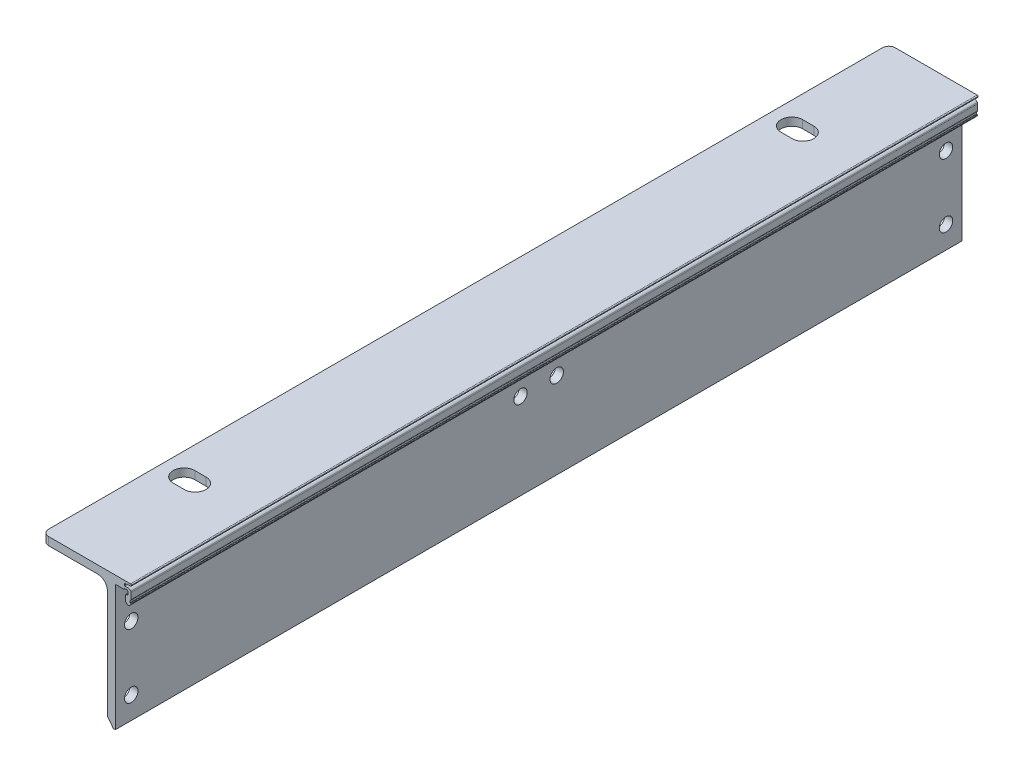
ISO-10303-21;
HEADER;
FILE_DESCRIPTION(('STEP AP214'),'2;1');
FILE_NAME('part.step','',(''),(''),'','','');
FILE_SCHEMA(('AUTOMOTIVE_DESIGN { 1 0 10303 214 1 1 1 1 }'));
ENDSEC;
DATA;
#1=APPLICATION_CONTEXT('core data for automotive mechanical design processes');
#2=APPLICATION_PROTOCOL_DEFINITION('international standard','automotive_design',2000,#1);
#3=PRODUCT_CONTEXT('',#1,'mechanical');
#4=PRODUCT('Part','Part','',(#3));
#5=PRODUCT_RELATED_PRODUCT_CATEGORY('part','',(#4));
#6=PRODUCT_DEFINITION_FORMATION('','',#4);
#7=PRODUCT_DEFINITION_CONTEXT('part definition',#1,'design');
#8=PRODUCT_DEFINITION('design','',#6,#7);
#9=PRODUCT_DEFINITION_SHAPE('','',#8);
#10=(LENGTH_UNIT() NAMED_UNIT(*) SI_UNIT(.MILLI.,.METRE.));
#11=(NAMED_UNIT(*) PLANE_ANGLE_UNIT() SI_UNIT($,.RADIAN.));
#12=(NAMED_UNIT(*) SI_UNIT($,.STERADIAN.) SOLID_ANGLE_UNIT());
#13=UNCERTAINTY_MEASURE_WITH_UNIT(LENGTH_MEASURE(1.E-05),#10,'distance_accuracy_value','');
#14=(GEOMETRIC_REPRESENTATION_CONTEXT(3) GLOBAL_UNCERTAINTY_ASSIGNED_CONTEXT((#13)) GLOBAL_UNIT_ASSIGNED_CONTEXT((#10,
#11,#12)) REPRESENTATION_CONTEXT('',''));
#15=CARTESIAN_POINT('',(0.,0.,0.));
#16=DIRECTION('',(0.,0.,1.));
#17=DIRECTION('',(1.,0.,0.));
#18=AXIS2_PLACEMENT_3D('',#15,#16,#17);
#19=CARTESIAN_POINT('',(2329.98403514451,-3290.10376988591,132.675));
#20=DIRECTION('',(0.,-1.,0.));
#21=DIRECTION('',(1.,0.,0.));
#22=AXIS2_PLACEMENT_3D('',#19,#20,#21);
#23=PLANE('',#22);
#24=DIRECTION('',(-1.,0.,0.));
#25=VECTOR('',#24,1.);
#26=CARTESIAN_POINT('',(2340.4840351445,-3290.10376988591,91.8500000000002));
#27=LINE('',#26,#25);
#28=CARTESIAN_POINT('',(2340.4840351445,-3290.10376988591,91.8500000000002));
#29=VERTEX_POINT('',#28);
#30=CARTESIAN_POINT('',(2336.9840351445,-3290.10376988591,91.8500000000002));
#31=VERTEX_POINT('',#30);
#32=EDGE_CURVE('E378',#29,#31,#27,.T.);
#33=ORIENTED_EDGE('',*,*,#32,.F.);
#34=CARTESIAN_POINT('',(2340.4840351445,-3290.10376988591,95.25));
#35=DIRECTION('',(0.,1.,0.));
#36=DIRECTION('',(1.,0.,0.));
#37=AXIS2_PLACEMENT_3D('',#34,#35,#36);
#38=CIRCLE('',#37,3.39999999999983);
#39=CARTESIAN_POINT('',(2340.4840351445,-3290.10376988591,98.6499999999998));
#40=VERTEX_POINT('',#39);
#41=EDGE_CURVE('E383',#40,#29,#38,.T.);
#42=ORIENTED_EDGE('',*,*,#41,.F.);
#43=DIRECTION('',(1.,0.,0.));
#44=VECTOR('',#43,1.);
#45=CARTESIAN_POINT('',(2340.4840351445,-3290.10376988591,98.6499999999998));
#46=LINE('',#45,#44);
#47=CARTESIAN_POINT('',(2336.9840351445,-3290.10376988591,98.6499999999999));
#48=VERTEX_POINT('',#47);
#49=EDGE_CURVE('E387',#48,#40,#46,.T.);
#50=ORIENTED_EDGE('',*,*,#49,.F.);
#51=CARTESIAN_POINT('',(2336.9840351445,-3290.10376988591,95.25));
#52=DIRECTION('',(0.,1.,0.));
#53=DIRECTION('',(1.,0.,0.));
#54=AXIS2_PLACEMENT_3D('',#51,#52,#53);
#55=CIRCLE('',#54,3.39999999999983);
#56=EDGE_CURVE('E367',#31,#48,#55,.T.);
#57=ORIENTED_EDGE('',*,*,#56,.F.);
#58=EDGE_LOOP('',(#33,#42,#50,#57));
#59=FACE_BOUND('',#58,.T.);
#60=DIRECTION('',(1.,0.,0.));
#61=VECTOR('',#60,1.);
#62=CARTESIAN_POINT('',(2340.4840351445,-3290.10376988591,-91.8500000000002));
#63=LINE('',#62,#61);
#64=CARTESIAN_POINT('',(2336.9840351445,-3290.10376988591,-91.8500000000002));
#65=VERTEX_POINT('',#64);
#66=CARTESIAN_POINT('',(2340.4840351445,-3290.10376988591,-91.8500000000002));
#67=VERTEX_POINT('',#66);
#68=EDGE_CURVE('E398',#65,#67,#63,.T.);
#69=ORIENTED_EDGE('',*,*,#68,.F.);
#70=CARTESIAN_POINT('',(2336.9840351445,-3290.10376988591,-95.25));
#71=DIRECTION('',(0.,1.,0.));
#72=DIRECTION('',(-1.,0.,0.));
#73=AXIS2_PLACEMENT_3D('',#70,#71,#72);
#74=CIRCLE('',#73,3.39999999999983);
#75=CARTESIAN_POINT('',(2336.9840351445,-3290.10376988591,-98.6499999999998));
#76=VERTEX_POINT('',#75);
#77=EDGE_CURVE('E394',#76,#65,#74,.T.);
#78=ORIENTED_EDGE('',*,*,#77,.F.);
#79=DIRECTION('',(-1.,0.,0.));
#80=VECTOR('',#79,1.);
#81=CARTESIAN_POINT('',(2340.4840351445,-3290.10376988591,-98.6499999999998));
#82=LINE('',#81,#80);
#83=CARTESIAN_POINT('',(2340.4840351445,-3290.10376988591,-98.6499999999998));
#84=VERTEX_POINT('',#83);
#85=EDGE_CURVE('E404',#84,#76,#82,.T.);
#86=ORIENTED_EDGE('',*,*,#85,.F.);
#87=CARTESIAN_POINT('',(2340.4840351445,-3290.10376988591,-95.25));
#88=DIRECTION('',(0.,1.,0.));
#89=DIRECTION('',(-1.,0.,0.));
#90=AXIS2_PLACEMENT_3D('',#87,#88,#89);
#91=CIRCLE('',#90,3.39999999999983);
#92=EDGE_CURVE('E401',#67,#84,#91,.T.);
#93=ORIENTED_EDGE('',*,*,#92,.F.);
#94=EDGE_LOOP('',(#69,#78,#86,#93));
#95=FACE_BOUND('',#94,.T.);
#96=DIRECTION('',(-1.,0.,0.));
#97=VECTOR('',#96,1.);
#98=CARTESIAN_POINT('',(2329.98403514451,-3290.10376988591,-132.675));
#99=LINE('',#98,#97);
#100=CARTESIAN_POINT('',(2357.62403514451,-3290.10376988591,-132.675));
#101=VERTEX_POINT('',#100);
#102=CARTESIAN_POINT('',(2331.98403514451,-3290.10376988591,-132.675));
#103=VERTEX_POINT('',#102);
#104=EDGE_CURVE('E410',#101,#103,#99,.T.);
#105=ORIENTED_EDGE('',*,*,#104,.T.);
#106=CARTESIAN_POINT('',(2331.98403514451,-3290.10376988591,-130.675));
#107=DIRECTION('',(0.,-1.,0.));
#108=DIRECTION('',(1.,0.,0.));
#109=AXIS2_PLACEMENT_3D('',#106,#107,#108);
#110=CIRCLE('',#109,2.);
#111=CARTESIAN_POINT('',(2329.98403514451,-3290.10376988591,-130.675));
#112=VERTEX_POINT('',#111);
#113=EDGE_CURVE('E44',#103,#112,#110,.F.);
#114=ORIENTED_EDGE('',*,*,#113,.T.);
#115=DIRECTION('',(0.,0.,-1.));
#116=VECTOR('',#115,1.);
#117=CARTESIAN_POINT('',(2329.98403514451,-3290.10376988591,132.675));
#118=LINE('',#117,#116);
#119=CARTESIAN_POINT('',(2329.98403514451,-3290.10376988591,130.675));
#120=VERTEX_POINT('',#119);
#121=EDGE_CURVE('E688',#120,#112,#118,.T.);
#122=ORIENTED_EDGE('',*,*,#121,.F.);
#123=CARTESIAN_POINT('',(2331.98403514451,-3290.10376988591,130.675));
#124=DIRECTION('',(0.,-1.,0.));
#125=DIRECTION('',(1.,0.,0.));
#126=AXIS2_PLACEMENT_3D('',#123,#124,#125);
#127=CIRCLE('',#126,2.);
#128=CARTESIAN_POINT('',(2331.98403514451,-3290.10376988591,132.675));
#129=VERTEX_POINT('',#128);
#130=EDGE_CURVE('E51',#120,#129,#127,.F.);
#131=ORIENTED_EDGE('',*,*,#130,.T.);
#132=DIRECTION('',(-1.,0.,0.));
#133=VECTOR('',#132,1.);
#134=CARTESIAN_POINT('',(2355.38403514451,-3290.10376988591,132.675));
#135=LINE('',#134,#133);
#136=CARTESIAN_POINT('',(2357.62403514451,-3290.10376988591,132.675));
#137=VERTEX_POINT('',#136);
#138=EDGE_CURVE('E417',#137,#129,#135,.T.);
#139=ORIENTED_EDGE('',*,*,#138,.F.);
#140=DIRECTION('',(0.,0.,-1.));
#141=VECTOR('',#140,1.);
#142=CARTESIAN_POINT('',(2357.62403514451,-3290.10376988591,132.675));
#143=LINE('',#142,#141);
#144=EDGE_CURVE('E496',#137,#101,#143,.T.);
#145=ORIENTED_EDGE('',*,*,#144,.T.);
#146=EDGE_LOOP('',(#105,#114,#122,#131,#139,#145));
#147=FACE_BOUND('',#146,.T.);
#148=ADVANCED_FACE('F36',(#59,#95,#147),#23,.F.);
#149=CARTESIAN_POINT('',(2329.98403514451,-3290.10376988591,132.675));
#150=DIRECTION('',(1.,0.,0.));
#151=DIRECTION('',(0.,0.,-1.));
#152=AXIS2_PLACEMENT_3D('',#149,#150,#151);
#153=PLANE('',#152);
#154=ORIENTED_EDGE('',*,*,#121,.T.);
#155=DIRECTION('',(0.,-1.,0.));
#156=VECTOR('',#155,1.);
#157=CARTESIAN_POINT('',(2329.98403514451,-3292.60376988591,-130.675));
#158=LINE('',#157,#156);
#159=CARTESIAN_POINT('',(2329.98403514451,-3292.60376988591,-130.675));
#160=VERTEX_POINT('',#159);
#161=EDGE_CURVE('E749',#112,#160,#158,.T.);
#162=ORIENTED_EDGE('',*,*,#161,.T.);
#163=DIRECTION('',(0.,0.,-1.));
#164=VECTOR('',#163,1.);
#165=CARTESIAN_POINT('',(2329.98403514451,-3292.60376988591,132.675));
#166=LINE('',#165,#164);
#167=CARTESIAN_POINT('',(2329.98403514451,-3292.60376988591,130.675));
#168=VERTEX_POINT('',#167);
#169=EDGE_CURVE('E685',#168,#160,#166,.T.);
#170=ORIENTED_EDGE('',*,*,#169,.F.);
#171=DIRECTION('',(0.,-1.,0.));
#172=VECTOR('',#171,1.);
#173=CARTESIAN_POINT('',(2329.98403514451,-3290.10376988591,130.675));
#174=LINE('',#173,#172);
#175=EDGE_CURVE('E723',#168,#120,#174,.F.);
#176=ORIENTED_EDGE('',*,*,#175,.T.);
#177=EDGE_LOOP('',(#154,#162,#170,#176));
#178=FACE_BOUND('',#177,.T.);
#179=ADVANCED_FACE('F761',(#178),#153,.F.);
#180=CARTESIAN_POINT('',(2329.98403514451,-3292.60376988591,132.675));
#181=DIRECTION('',(0.,1.,0.));
#182=DIRECTION('',(0.,0.,1.));
#183=AXIS2_PLACEMENT_3D('',#180,#181,#182);
#184=PLANE('',#183);
#185=DIRECTION('',(1.,0.,0.));
#186=VECTOR('',#185,1.);
#187=CARTESIAN_POINT('',(2329.98403514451,-3292.60376988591,98.6499999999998));
#188=LINE('',#187,#186);
#189=CARTESIAN_POINT('',(2336.9840351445,-3292.60376988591,98.6499999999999));
#190=VERTEX_POINT('',#189);
#191=CARTESIAN_POINT('',(2340.4840351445,-3292.60376988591,98.6499999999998));
#192=VERTEX_POINT('',#191);
#193=EDGE_CURVE('E717',#190,#192,#188,.T.);
#194=ORIENTED_EDGE('',*,*,#193,.T.);
#195=CARTESIAN_POINT('',(2340.4840351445,-3292.60376988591,95.25));
#196=DIRECTION('',(0.,1.,0.));
#197=DIRECTION('',(0.,0.,1.));
#198=AXIS2_PLACEMENT_3D('',#195,#196,#197);
#199=CIRCLE('',#198,3.39999999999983);
#200=CARTESIAN_POINT('',(2340.4840351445,-3292.60376988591,91.8500000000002));
#201=VERTEX_POINT('',#200);
#202=EDGE_CURVE('E720',#192,#201,#199,.T.);
#203=ORIENTED_EDGE('',*,*,#202,.T.);
#204=DIRECTION('',(-1.,0.,0.));
#205=VECTOR('',#204,1.);
#206=CARTESIAN_POINT('',(2329.98403514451,-3292.60376988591,91.8500000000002));
#207=LINE('',#206,#205);
#208=CARTESIAN_POINT('',(2336.9840351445,-3292.60376988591,91.8500000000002));
#209=VERTEX_POINT('',#208);
#210=EDGE_CURVE('E714',#201,#209,#207,.T.);
#211=ORIENTED_EDGE('',*,*,#210,.T.);
#212=CARTESIAN_POINT('',(2336.9840351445,-3292.60376988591,95.25));
#213=DIRECTION('',(0.,1.,0.));
#214=DIRECTION('',(0.,0.,1.));
#215=AXIS2_PLACEMENT_3D('',#212,#213,#214);
#216=CIRCLE('',#215,3.39999999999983);
#217=EDGE_CURVE('E370',#209,#190,#216,.T.);
#218=ORIENTED_EDGE('',*,*,#217,.T.);
#219=EDGE_LOOP('',(#194,#203,#211,#218));
#220=FACE_BOUND('',#219,.T.);
#221=DIRECTION('',(-1.,0.,0.));
#222=VECTOR('',#221,1.);
#223=CARTESIAN_POINT('',(2329.98403514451,-3292.60376988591,-98.6499999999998));
#224=LINE('',#223,#222);
#225=CARTESIAN_POINT('',(2340.4840351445,-3292.60376988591,-98.6499999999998));
#226=VERTEX_POINT('',#225);
#227=CARTESIAN_POINT('',(2336.9840351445,-3292.60376988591,-98.6499999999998));
#228=VERTEX_POINT('',#227);
#229=EDGE_CURVE('E708',#226,#228,#224,.T.);
#230=ORIENTED_EDGE('',*,*,#229,.T.);
#231=CARTESIAN_POINT('',(2336.9840351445,-3292.60376988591,-95.25));
#232=DIRECTION('',(0.,1.,0.));
#233=DIRECTION('',(0.,0.,1.));
#234=AXIS2_PLACEMENT_3D('',#231,#232,#233);
#235=CIRCLE('',#234,3.39999999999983);
#236=CARTESIAN_POINT('',(2336.9840351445,-3292.60376988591,-91.8500000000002));
#237=VERTEX_POINT('',#236);
#238=EDGE_CURVE('E711',#228,#237,#235,.T.);
#239=ORIENTED_EDGE('',*,*,#238,.T.);
#240=DIRECTION('',(1.,0.,0.));
#241=VECTOR('',#240,1.);
#242=CARTESIAN_POINT('',(2329.98403514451,-3292.60376988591,-91.8500000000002));
#243=LINE('',#242,#241);
#244=CARTESIAN_POINT('',(2340.4840351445,-3292.60376988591,-91.8500000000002));
#245=VERTEX_POINT('',#244);
#246=EDGE_CURVE('E702',#237,#245,#243,.T.);
#247=ORIENTED_EDGE('',*,*,#246,.T.);
#248=CARTESIAN_POINT('',(2340.4840351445,-3292.60376988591,-95.25));
#249=DIRECTION('',(0.,1.,0.));
#250=DIRECTION('',(0.,0.,1.));
#251=AXIS2_PLACEMENT_3D('',#248,#249,#250);
#252=CIRCLE('',#251,3.39999999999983);
#253=EDGE_CURVE('E705',#245,#226,#252,.T.);
#254=ORIENTED_EDGE('',*,*,#253,.T.);
#255=EDGE_LOOP('',(#230,#239,#247,#254));
#256=FACE_BOUND('',#255,.T.);
#257=ORIENTED_EDGE('',*,*,#169,.T.);
#258=CARTESIAN_POINT('',(2331.98403514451,-3292.60376988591,-130.675));
#259=DIRECTION('',(0.,1.,0.));
#260=DIRECTION('',(0.,0.,1.));
#261=AXIS2_PLACEMENT_3D('',#258,#259,#260);
#262=CIRCLE('',#261,2.);
#263=CARTESIAN_POINT('',(2331.98403514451,-3292.60376988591,-132.675));
#264=VERTEX_POINT('',#263);
#265=EDGE_CURVE('E754',#160,#264,#262,.F.);
#266=ORIENTED_EDGE('',*,*,#265,.T.);
#267=DIRECTION('',(1.,0.,0.));
#268=VECTOR('',#267,1.);
#269=CARTESIAN_POINT('',(2329.98403514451,-3292.60376988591,-132.675));
#270=LINE('',#269,#268);
#271=CARTESIAN_POINT('',(2347.3840351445,-3292.60376988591,-132.675));
#272=VERTEX_POINT('',#271);
#273=EDGE_CURVE('E498',#264,#272,#270,.T.);
#274=ORIENTED_EDGE('',*,*,#273,.T.);
#275=DIRECTION('',(0.,0.,-1.));
#276=VECTOR('',#275,1.);
#277=CARTESIAN_POINT('',(2347.3840351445,-3292.60376988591,132.675));
#278=LINE('',#277,#276);
#279=CARTESIAN_POINT('',(2347.3840351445,-3292.60376988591,132.675));
#280=VERTEX_POINT('',#279);
#281=EDGE_CURVE('E694',#272,#280,#278,.F.);
#282=ORIENTED_EDGE('',*,*,#281,.T.);
#283=DIRECTION('',(1.,0.,0.));
#284=VECTOR('',#283,1.);
#285=CARTESIAN_POINT('',(2329.98403514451,-3292.60376988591,132.675));
#286=LINE('',#285,#284);
#287=CARTESIAN_POINT('',(2331.98403514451,-3292.60376988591,132.675));
#288=VERTEX_POINT('',#287);
#289=EDGE_CURVE('E419',#288,#280,#286,.T.);
#290=ORIENTED_EDGE('',*,*,#289,.F.);
#291=CARTESIAN_POINT('',(2331.98403514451,-3292.60376988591,130.675));
#292=DIRECTION('',(0.,1.,0.));
#293=DIRECTION('',(0.,0.,1.));
#294=AXIS2_PLACEMENT_3D('',#291,#292,#293);
#295=CIRCLE('',#294,2.);
#296=EDGE_CURVE('E752',#288,#168,#295,.F.);
#297=ORIENTED_EDGE('',*,*,#296,.T.);
#298=EDGE_LOOP('',(#257,#266,#274,#282,#290,#297));
#299=FACE_BOUND('',#298,.T.);
#300=ADVANCED_FACE('F766',(#220,#256,#299),#184,.F.);
#301=CARTESIAN_POINT('',(2350.3840351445,-3292.60376988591,132.675));
#302=DIRECTION('',(1.,0.,0.));
#303=DIRECTION('',(0.,0.,-1.));
#304=AXIS2_PLACEMENT_3D('',#301,#302,#303);
#305=PLANE('',#304);
#306=CARTESIAN_POINT('',(2350.38403514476,-3325.10376988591,127.675));
#307=DIRECTION('',(-1.,0.,0.));
#308=DIRECTION('',(0.,1.,0.));
#309=AXIS2_PLACEMENT_3D('',#306,#307,#308);
#310=CIRCLE('',#309,2.09999999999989);
#311=CARTESIAN_POINT('',(2350.38403514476,-3323.00376988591,127.675));
#312=VERTEX_POINT('',#311);
#313=EDGE_CURVE('E747',#312,#312,#310,.T.);
#314=ORIENTED_EDGE('',*,*,#313,.F.);
#315=EDGE_LOOP('',(#314));
#316=FACE_BOUND('',#315,.T.);
#317=CARTESIAN_POINT('',(2350.38403514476,-3325.10376988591,-127.675));
#318=DIRECTION('',(-1.,0.,0.));
#319=DIRECTION('',(0.,-1.,0.));
#320=AXIS2_PLACEMENT_3D('',#317,#318,#319);
#321=CIRCLE('',#320,2.09999999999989);
#322=CARTESIAN_POINT('',(2350.38403514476,-3327.20376988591,-127.675));
#323=VERTEX_POINT('',#322);
#324=EDGE_CURVE('E743',#323,#323,#321,.T.);
#325=ORIENTED_EDGE('',*,*,#324,.F.);
#326=EDGE_LOOP('',(#325));
#327=FACE_BOUND('',#326,.T.);
#328=CARTESIAN_POINT('',(2350.38403514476,-3305.10376988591,-5.675));
#329=DIRECTION('',(-1.,0.,0.));
#330=DIRECTION('',(0.,-1.,0.));
#331=AXIS2_PLACEMENT_3D('',#328,#329,#330);
#332=CIRCLE('',#331,2.09999999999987);
#333=CARTESIAN_POINT('',(2350.38403514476,-3307.20376988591,-5.675));
#334=VERTEX_POINT('',#333);
#335=EDGE_CURVE('E739',#334,#334,#332,.T.);
#336=ORIENTED_EDGE('',*,*,#335,.F.);
#337=EDGE_LOOP('',(#336));
#338=FACE_BOUND('',#337,.T.);
#339=CARTESIAN_POINT('',(2350.38403514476,-3305.10376988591,5.675));
#340=DIRECTION('',(-1.,0.,0.));
#341=DIRECTION('',(0.,-1.,0.));
#342=AXIS2_PLACEMENT_3D('',#339,#340,#341);
#343=CIRCLE('',#342,2.09999999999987);
#344=CARTESIAN_POINT('',(2350.38403514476,-3307.20376988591,5.675));
#345=VERTEX_POINT('',#344);
#346=EDGE_CURVE('E735',#345,#345,#343,.T.);
#347=ORIENTED_EDGE('',*,*,#346,.F.);
#348=EDGE_LOOP('',(#347));
#349=FACE_BOUND('',#348,.T.);
#350=CARTESIAN_POINT('',(2350.38403514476,-3305.10376988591,127.675));
#351=DIRECTION('',(-1.,0.,0.));
#352=DIRECTION('',(0.,1.,0.));
#353=AXIS2_PLACEMENT_3D('',#350,#351,#352);
#354=CIRCLE('',#353,2.09999999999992);
#355=CARTESIAN_POINT('',(2350.38403514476,-3303.00376988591,127.675));
#356=VERTEX_POINT('',#355);
#357=EDGE_CURVE('E731',#356,#356,#354,.T.);
#358=ORIENTED_EDGE('',*,*,#357,.F.);
#359=EDGE_LOOP('',(#358));
#360=FACE_BOUND('',#359,.T.);
#361=CARTESIAN_POINT('',(2350.38403514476,-3305.10376988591,-127.675));
#362=DIRECTION('',(-1.,0.,0.));
#363=DIRECTION('',(0.,-1.,0.));
#364=AXIS2_PLACEMENT_3D('',#361,#362,#363);
#365=CIRCLE('',#364,2.09999999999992);
#366=CARTESIAN_POINT('',(2350.38403514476,-3307.20376988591,-127.675));
#367=VERTEX_POINT('',#366);
#368=EDGE_CURVE('E727',#367,#367,#365,.T.);
#369=ORIENTED_EDGE('',*,*,#368,.F.);
#370=EDGE_LOOP('',(#369));
#371=FACE_BOUND('',#370,.T.);
#372=DIRECTION('',(0.,-1.,0.));
#373=VECTOR('',#372,1.);
#374=CARTESIAN_POINT('',(2350.3840351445,-3292.60376988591,132.675));
#375=LINE('',#374,#373);
#376=CARTESIAN_POINT('',(2350.3840351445,-3295.60376988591,132.675));
#377=VERTEX_POINT('',#376);
#378=CARTESIAN_POINT('',(2350.3840351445,-3329.60376988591,132.675));
#379=VERTEX_POINT('',#378);
#380=EDGE_CURVE('E422',#377,#379,#375,.T.);
#381=ORIENTED_EDGE('',*,*,#380,.F.);
#382=DIRECTION('',(0.,0.,-1.));
#383=VECTOR('',#382,1.);
#384=CARTESIAN_POINT('',(2350.3840351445,-3295.60376988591,-132.675));
#385=LINE('',#384,#383);
#386=CARTESIAN_POINT('',(2350.3840351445,-3295.60376988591,-132.675));
#387=VERTEX_POINT('',#386);
#388=EDGE_CURVE('E691',#377,#387,#385,.T.);
#389=ORIENTED_EDGE('',*,*,#388,.T.);
#390=DIRECTION('',(0.,-1.,0.));
#391=VECTOR('',#390,1.);
#392=CARTESIAN_POINT('',(2350.3840351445,-3292.60376988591,-132.675));
#393=LINE('',#392,#391);
#394=CARTESIAN_POINT('',(2350.3840351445,-3329.60376988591,-132.675));
#395=VERTEX_POINT('',#394);
#396=EDGE_CURVE('E500',#387,#395,#393,.T.);
#397=ORIENTED_EDGE('',*,*,#396,.T.);
#398=DIRECTION('',(0.,0.,-1.));
#399=VECTOR('',#398,1.);
#400=CARTESIAN_POINT('',(2350.3840351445,-3329.60376988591,132.675));
#401=LINE('',#400,#399);
#402=EDGE_CURVE('E682',#379,#395,#401,.T.);
#403=ORIENTED_EDGE('',*,*,#402,.F.);
#404=EDGE_LOOP('',(#381,#389,#397,#403));
#405=FACE_BOUND('',#404,.T.);
#406=ADVANCED_FACE('F952',(#316,#327,#338,#349,#360,#371,#405),#305,.F.);
#407=CARTESIAN_POINT('',(2350.3840351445,-3329.60376988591,132.675));
#408=DIRECTION('',(0.796162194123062,0.605083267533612,0.));
#409=DIRECTION('',(-0.605083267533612,0.796162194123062,0.));
#410=AXIS2_PLACEMENT_3D('',#407,#408,#409);
#411=PLANE('',#410);
#412=DIRECTION('',(0.605083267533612,-0.796162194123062,0.));
#413=VECTOR('',#412,1.);
#414=CARTESIAN_POINT('',(2350.3840351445,-3329.60376988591,-132.675));
#415=LINE('',#414,#413);
#416=CARTESIAN_POINT('',(2352.28403514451,-3332.10376988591,-132.675));
#417=VERTEX_POINT('',#416);
#418=EDGE_CURVE('E502',#395,#417,#415,.T.);
#419=ORIENTED_EDGE('',*,*,#418,.T.);
#420=DIRECTION('',(0.,0.,-1.));
#421=VECTOR('',#420,1.);
#422=CARTESIAN_POINT('',(2352.28403514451,-3332.10376988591,132.675));
#423=LINE('',#422,#421);
#424=CARTESIAN_POINT('',(2352.28403514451,-3332.10376988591,132.675));
#425=VERTEX_POINT('',#424);
#426=EDGE_CURVE('E679',#425,#417,#423,.T.);
#427=ORIENTED_EDGE('',*,*,#426,.F.);
#428=DIRECTION('',(0.605083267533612,-0.796162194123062,0.));
#429=VECTOR('',#428,1.);
#430=CARTESIAN_POINT('',(2350.3840351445,-3329.60376988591,132.675));
#431=LINE('',#430,#429);
#432=EDGE_CURVE('E424',#379,#425,#431,.T.);
#433=ORIENTED_EDGE('',*,*,#432,.F.);
#434=ORIENTED_EDGE('',*,*,#402,.T.);
#435=EDGE_LOOP('',(#419,#427,#433,#434));
#436=FACE_BOUND('',#435,.T.);
#437=ADVANCED_FACE('F948',(#436),#411,.F.);
#438=CARTESIAN_POINT('',(2352.88403514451,-3332.10376988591,132.675));
#439=DIRECTION('',(0.,1.,0.));
#440=DIRECTION('',(0.,0.,1.));
#441=AXIS2_PLACEMENT_3D('',#438,#439,#440);
#442=PLANE('',#441);
#443=DIRECTION('',(1.,0.,0.));
#444=VECTOR('',#443,1.);
#445=CARTESIAN_POINT('',(2352.88403514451,-3332.10376988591,-132.675));
#446=LINE('',#445,#444);
#447=CARTESIAN_POINT('',(2352.88403514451,-3332.10376988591,-132.675));
#448=VERTEX_POINT('',#447);
#449=EDGE_CURVE('E504',#417,#448,#446,.T.);
#450=ORIENTED_EDGE('',*,*,#449,.T.);
#451=DIRECTION('',(0.,0.,-1.));
#452=VECTOR('',#451,1.);
#453=CARTESIAN_POINT('',(2352.88403514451,-3332.10376988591,132.675));
#454=LINE('',#453,#452);
#455=CARTESIAN_POINT('',(2352.88403514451,-3332.10376988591,132.675));
#456=VERTEX_POINT('',#455);
#457=EDGE_CURVE('E676',#456,#448,#454,.T.);
#458=ORIENTED_EDGE('',*,*,#457,.F.);
#459=DIRECTION('',(1.,0.,0.));
#460=VECTOR('',#459,1.);
#461=CARTESIAN_POINT('',(2352.88403514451,-3332.10376988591,132.675));
#462=LINE('',#461,#460);
#463=EDGE_CURVE('E426',#425,#456,#462,.T.);
#464=ORIENTED_EDGE('',*,*,#463,.F.);
#465=ORIENTED_EDGE('',*,*,#426,.T.);
#466=EDGE_LOOP('',(#450,#458,#464,#465));
#467=FACE_BOUND('',#466,.T.);
#468=ADVANCED_FACE('F944',(#467),#442,.F.);
#469=CARTESIAN_POINT('',(2352.88403514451,-3292.60376988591,132.675));
#470=DIRECTION('',(-1.,0.,0.));
#471=DIRECTION('',(0.,0.,1.));
#472=AXIS2_PLACEMENT_3D('',#469,#470,#471);
#473=PLANE('',#472);
#474=CARTESIAN_POINT('',(2352.88403514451,-3325.10376988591,127.675));
#475=DIRECTION('',(-1.,0.,0.));
#476=DIRECTION('',(0.,0.,1.));
#477=AXIS2_PLACEMENT_3D('',#474,#475,#476);
#478=CIRCLE('',#477,2.09999999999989);
#479=CARTESIAN_POINT('',(2352.88403514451,-3325.10376988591,129.775));
#480=VERTEX_POINT('',#479);
#481=EDGE_CURVE('E744',#480,#480,#478,.T.);
#482=ORIENTED_EDGE('',*,*,#481,.T.);
#483=EDGE_LOOP('',(#482));
#484=FACE_BOUND('',#483,.T.);
#485=CARTESIAN_POINT('',(2352.88403514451,-3325.10376988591,-127.675));
#486=DIRECTION('',(-1.,0.,0.));
#487=DIRECTION('',(0.,0.,1.));
#488=AXIS2_PLACEMENT_3D('',#485,#486,#487);
#489=CIRCLE('',#488,2.09999999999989);
#490=CARTESIAN_POINT('',(2352.88403514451,-3325.10376988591,-125.575));
#491=VERTEX_POINT('',#490);
#492=EDGE_CURVE('E740',#491,#491,#489,.T.);
#493=ORIENTED_EDGE('',*,*,#492,.T.);
#494=EDGE_LOOP('',(#493));
#495=FACE_BOUND('',#494,.T.);
#496=CARTESIAN_POINT('',(2352.88403514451,-3305.10376988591,-5.675));
#497=DIRECTION('',(-1.,0.,0.));
#498=DIRECTION('',(0.,0.,1.));
#499=AXIS2_PLACEMENT_3D('',#496,#497,#498);
#500=CIRCLE('',#499,2.09999999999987);
#501=CARTESIAN_POINT('',(2352.88403514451,-3305.10376988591,-3.57500000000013));
#502=VERTEX_POINT('',#501);
#503=EDGE_CURVE('E736',#502,#502,#500,.T.);
#504=ORIENTED_EDGE('',*,*,#503,.T.);
#505=EDGE_LOOP('',(#504));
#506=FACE_BOUND('',#505,.T.);
#507=CARTESIAN_POINT('',(2352.88403514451,-3305.10376988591,5.675));
#508=DIRECTION('',(-1.,0.,0.));
#509=DIRECTION('',(0.,0.,1.));
#510=AXIS2_PLACEMENT_3D('',#507,#508,#509);
#511=CIRCLE('',#510,2.09999999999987);
#512=CARTESIAN_POINT('',(2352.88403514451,-3305.10376988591,7.77499999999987));
#513=VERTEX_POINT('',#512);
#514=EDGE_CURVE('E732',#513,#513,#511,.T.);
#515=ORIENTED_EDGE('',*,*,#514,.T.);
#516=EDGE_LOOP('',(#515));
#517=FACE_BOUND('',#516,.T.);
#518=CARTESIAN_POINT('',(2352.88403514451,-3305.10376988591,127.675));
#519=DIRECTION('',(-1.,0.,0.));
#520=DIRECTION('',(0.,0.,1.));
#521=AXIS2_PLACEMENT_3D('',#518,#519,#520);
#522=CIRCLE('',#521,2.09999999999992);
#523=CARTESIAN_POINT('',(2352.88403514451,-3305.10376988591,129.775));
#524=VERTEX_POINT('',#523);
#525=EDGE_CURVE('E728',#524,#524,#522,.T.);
#526=ORIENTED_EDGE('',*,*,#525,.T.);
#527=EDGE_LOOP('',(#526));
#528=FACE_BOUND('',#527,.T.);
#529=CARTESIAN_POINT('',(2352.88403514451,-3305.10376988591,-127.675));
#530=DIRECTION('',(-1.,0.,0.));
#531=DIRECTION('',(0.,0.,1.));
#532=AXIS2_PLACEMENT_3D('',#529,#530,#531);
#533=CIRCLE('',#532,2.09999999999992);
#534=CARTESIAN_POINT('',(2352.88403514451,-3305.10376988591,-125.575));
#535=VERTEX_POINT('',#534);
#536=EDGE_CURVE('E724',#535,#535,#533,.T.);
#537=ORIENTED_EDGE('',*,*,#536,.T.);
#538=EDGE_LOOP('',(#537));
#539=FACE_BOUND('',#538,.T.);
#540=DIRECTION('',(0.,1.,0.));
#541=VECTOR('',#540,1.);
#542=CARTESIAN_POINT('',(2352.88403514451,-3292.60376988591,-132.675));
#543=LINE('',#542,#541);
#544=CARTESIAN_POINT('',(2352.88403514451,-3292.60376988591,-132.675));
#545=VERTEX_POINT('',#544);
#546=EDGE_CURVE('E506',#448,#545,#543,.T.);
#547=ORIENTED_EDGE('',*,*,#546,.T.);
#548=DIRECTION('',(0.,0.,-1.));
#549=VECTOR('',#548,1.);
#550=CARTESIAN_POINT('',(2352.88403514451,-3292.60376988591,132.675));
#551=LINE('',#550,#549);
#552=CARTESIAN_POINT('',(2352.88403514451,-3292.60376988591,132.675));
#553=VERTEX_POINT('',#552);
#554=EDGE_CURVE('E673',#553,#545,#551,.T.);
#555=ORIENTED_EDGE('',*,*,#554,.F.);
#556=DIRECTION('',(0.,1.,0.));
#557=VECTOR('',#556,1.);
#558=CARTESIAN_POINT('',(2352.88403514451,-3292.60376988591,132.675));
#559=LINE('',#558,#557);
#560=EDGE_CURVE('E428',#456,#553,#559,.T.);
#561=ORIENTED_EDGE('',*,*,#560,.F.);
#562=ORIENTED_EDGE('',*,*,#457,.T.);
#563=EDGE_LOOP('',(#547,#555,#561,#562));
#564=FACE_BOUND('',#563,.T.);
#565=ADVANCED_FACE('F940',(#484,#495,#506,#517,#528,#539,#564),#473,.F.);
#566=CARTESIAN_POINT('',(2355.38403514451,-3292.60376988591,132.675));
#567=DIRECTION('',(0.,1.,0.));
#568=DIRECTION('',(0.,0.,1.));
#569=AXIS2_PLACEMENT_3D('',#566,#567,#568);
#570=PLANE('',#569);
#571=DIRECTION('',(1.,0.,0.));
#572=VECTOR('',#571,1.);
#573=CARTESIAN_POINT('',(2355.38403514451,-3292.60376988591,-132.675));
#574=LINE('',#573,#572);
#575=CARTESIAN_POINT('',(2355.46834905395,-3292.60376988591,-132.675));
#576=VERTEX_POINT('',#575);
#577=EDGE_CURVE('E509',#545,#576,#574,.T.);
#578=ORIENTED_EDGE('',*,*,#577,.T.);
#579=DIRECTION('',(0.,0.,-1.));
#580=VECTOR('',#579,1.);
#581=CARTESIAN_POINT('',(2355.46834905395,-3292.60376988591,132.675));
#582=LINE('',#581,#580);
#583=CARTESIAN_POINT('',(2355.46834905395,-3292.60376988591,132.675));
#584=VERTEX_POINT('',#583);
#585=EDGE_CURVE('E670',#584,#576,#582,.T.);
#586=ORIENTED_EDGE('',*,*,#585,.F.);
#587=DIRECTION('',(1.,-3.55271367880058E-13,0.));
#588=VECTOR('',#587,1.);
#589=CARTESIAN_POINT('',(2352.88403514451,-3292.60376988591,132.675));
#590=LINE('',#589,#588);
#591=EDGE_CURVE('E430',#553,#584,#590,.T.);
#592=ORIENTED_EDGE('',*,*,#591,.F.);
#593=ORIENTED_EDGE('',*,*,#554,.T.);
#594=EDGE_LOOP('',(#578,#586,#592,#593));
#595=FACE_BOUND('',#594,.T.);
#596=ADVANCED_FACE('F936',(#595),#570,.F.);
#597=CARTESIAN_POINT('',(2355.46834905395,-3292.30376988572,132.675));
#598=DIRECTION('',(0.,0.,-1.));
#599=DIRECTION('',(-1.,0.,0.));
#600=AXIS2_PLACEMENT_3D('',#597,#598,#599);
#601=CYLINDRICAL_SURFACE('',#600,0.300000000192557);
#602=CARTESIAN_POINT('',(2355.46834905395,-3292.30376988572,-132.675));
#603=DIRECTION('',(0.,0.,1.));
#604=DIRECTION('',(-1.,0.,0.));
#605=AXIS2_PLACEMENT_3D('',#602,#603,#604);
#606=CIRCLE('',#605,0.300000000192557);
#607=CARTESIAN_POINT('',(2355.72815667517,-3292.45376988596,-132.675));
#608=VERTEX_POINT('',#607);
#609=EDGE_CURVE('E511',#576,#608,#606,.T.);
#610=ORIENTED_EDGE('',*,*,#609,.T.);
#611=DIRECTION('',(0.,0.,-1.));
#612=VECTOR('',#611,1.);
#613=CARTESIAN_POINT('',(2355.72815667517,-3292.45376988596,132.675));
#614=LINE('',#613,#612);
#615=CARTESIAN_POINT('',(2355.72815667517,-3292.45376988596,132.675));
#616=VERTEX_POINT('',#615);
#617=EDGE_CURVE('E667',#616,#608,#614,.T.);
#618=ORIENTED_EDGE('',*,*,#617,.F.);
#619=CARTESIAN_POINT('',(2355.46834905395,-3292.30376988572,132.675));
#620=DIRECTION('',(0.,0.,1.));
#621=DIRECTION('',(-1.,0.,0.));
#622=AXIS2_PLACEMENT_3D('',#619,#620,#621);
#623=CIRCLE('',#622,0.300000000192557);
#624=EDGE_CURVE('E432',#584,#616,#623,.T.);
#625=ORIENTED_EDGE('',*,*,#624,.F.);
#626=ORIENTED_EDGE('',*,*,#585,.T.);
#627=EDGE_LOOP('',(#610,#618,#625,#626));
#628=FACE_BOUND('',#627,.T.);
#629=ADVANCED_FACE('F932',(#628),#601,.T.);
#630=CARTESIAN_POINT('',(2355.9879642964,-3292.60376988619,132.675));
#631=DIRECTION('',(0.,0.,-1.));
#632=DIRECTION('',(-1.,0.,0.));
#633=AXIS2_PLACEMENT_3D('',#630,#631,#632);
#634=CYLINDRICAL_SURFACE('',#633,0.300000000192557);
#635=CARTESIAN_POINT('',(2355.9879642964,-3292.60376988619,-132.675));
#636=DIRECTION('',(0.,0.,-1.));
#637=DIRECTION('',(-1.,0.,0.));
#638=AXIS2_PLACEMENT_3D('',#635,#636,#637);
#639=CIRCLE('',#638,0.300000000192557);
#640=CARTESIAN_POINT('',(2355.9879642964,-3292.303769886,-132.675));
#641=VERTEX_POINT('',#640);
#642=EDGE_CURVE('E513',#608,#641,#639,.T.);
#643=ORIENTED_EDGE('',*,*,#642,.T.);
#644=DIRECTION('',(0.,0.,-1.));
#645=VECTOR('',#644,1.);
#646=CARTESIAN_POINT('',(2355.9879642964,-3292.303769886,132.675));
#647=LINE('',#646,#645);
#648=CARTESIAN_POINT('',(2355.9879642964,-3292.303769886,132.675));
#649=VERTEX_POINT('',#648);
#650=EDGE_CURVE('E664',#649,#641,#647,.T.);
#651=ORIENTED_EDGE('',*,*,#650,.F.);
#652=CARTESIAN_POINT('',(2355.9879642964,-3292.60376988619,132.675));
#653=DIRECTION('',(0.,0.,-1.));
#654=DIRECTION('',(-1.,0.,0.));
#655=AXIS2_PLACEMENT_3D('',#652,#653,#654);
#656=CIRCLE('',#655,0.300000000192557);
#657=EDGE_CURVE('E434',#616,#649,#656,.T.);
#658=ORIENTED_EDGE('',*,*,#657,.F.);
#659=ORIENTED_EDGE('',*,*,#617,.T.);
#660=EDGE_LOOP('',(#643,#651,#658,#659));
#661=FACE_BOUND('',#660,.T.);
#662=ADVANCED_FACE('F928',(#661),#634,.F.);
#663=CARTESIAN_POINT('',(2356.52403514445,-3292.303769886,132.675));
#664=DIRECTION('',(0.,1.,0.));
#665=DIRECTION('',(0.,0.,1.));
#666=AXIS2_PLACEMENT_3D('',#663,#664,#665);
#667=PLANE('',#666);
#668=DIRECTION('',(1.,0.,0.));
#669=VECTOR('',#668,1.);
#670=CARTESIAN_POINT('',(2356.52403514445,-3292.303769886,-132.675));
#671=LINE('',#670,#669);
#672=CARTESIAN_POINT('',(2356.52403514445,-3292.303769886,-132.675));
#673=VERTEX_POINT('',#672);
#674=EDGE_CURVE('E515',#641,#673,#671,.T.);
#675=ORIENTED_EDGE('',*,*,#674,.T.);
#676=DIRECTION('',(0.,0.,-1.));
#677=VECTOR('',#676,1.);
#678=CARTESIAN_POINT('',(2356.52403514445,-3292.303769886,132.675));
#679=LINE('',#678,#677);
#680=CARTESIAN_POINT('',(2356.52403514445,-3292.303769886,132.675));
#681=VERTEX_POINT('',#680);
#682=EDGE_CURVE('E661',#681,#673,#679,.T.);
#683=ORIENTED_EDGE('',*,*,#682,.F.);
#684=DIRECTION('',(1.,0.,0.));
#685=VECTOR('',#684,1.);
#686=CARTESIAN_POINT('',(2356.52403514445,-3292.303769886,132.675));
#687=LINE('',#686,#685);
#688=EDGE_CURVE('E436',#649,#681,#687,.T.);
#689=ORIENTED_EDGE('',*,*,#688,.F.);
#690=ORIENTED_EDGE('',*,*,#650,.T.);
#691=EDGE_LOOP('',(#675,#683,#689,#690));
#692=FACE_BOUND('',#691,.T.);
#693=ADVANCED_FACE('F924',(#692),#667,.F.);
#694=CARTESIAN_POINT('',(2356.52403514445,-3292.603769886,132.675));
#695=DIRECTION('',(0.,0.,-1.));
#696=DIRECTION('',(-1.,0.,0.));
#697=AXIS2_PLACEMENT_3D('',#694,#695,#696);
#698=CYLINDRICAL_SURFACE('',#697,0.300000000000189);
#699=CARTESIAN_POINT('',(2356.52403514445,-3292.603769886,-132.675));
#700=DIRECTION('',(0.,0.,-1.));
#701=DIRECTION('',(-1.,0.,0.));
#702=AXIS2_PLACEMENT_3D('',#699,#700,#701);
#703=CIRCLE('',#702,0.300000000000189);
#704=CARTESIAN_POINT('',(2356.82403514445,-3292.603769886,-132.675));
#705=VERTEX_POINT('',#704);
#706=EDGE_CURVE('E517',#673,#705,#703,.T.);
#707=ORIENTED_EDGE('',*,*,#706,.T.);
#708=DIRECTION('',(0.,0.,-1.));
#709=VECTOR('',#708,1.);
#710=CARTESIAN_POINT('',(2356.82403514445,-3292.603769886,132.675));
#711=LINE('',#710,#709);
#712=CARTESIAN_POINT('',(2356.82403514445,-3292.603769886,132.675));
#713=VERTEX_POINT('',#712);
#714=EDGE_CURVE('E658',#713,#705,#711,.T.);
#715=ORIENTED_EDGE('',*,*,#714,.F.);
#716=CARTESIAN_POINT('',(2356.52403514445,-3292.603769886,132.675));
#717=DIRECTION('',(0.,0.,-1.));
#718=DIRECTION('',(-1.,0.,0.));
#719=AXIS2_PLACEMENT_3D('',#716,#717,#718);
#720=CIRCLE('',#719,0.300000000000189);
#721=EDGE_CURVE('E438',#681,#713,#720,.T.);
#722=ORIENTED_EDGE('',*,*,#721,.F.);
#723=ORIENTED_EDGE('',*,*,#682,.T.);
#724=EDGE_LOOP('',(#707,#715,#722,#723));
#725=FACE_BOUND('',#724,.T.);
#726=ADVANCED_FACE('F920',(#725),#698,.F.);
#727=CARTESIAN_POINT('',(2356.82403514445,-3293.40376988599,132.675));
#728=DIRECTION('',(1.,0.,0.));
#729=DIRECTION('',(0.,0.,-1.));
#730=AXIS2_PLACEMENT_3D('',#727,#728,#729);
#731=PLANE('',#730);
#732=DIRECTION('',(0.,-1.,0.));
#733=VECTOR('',#732,1.);
#734=CARTESIAN_POINT('',(2356.82403514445,-3293.40376988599,-132.675));
#735=LINE('',#734,#733);
#736=CARTESIAN_POINT('',(2356.82403514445,-3293.40376988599,-132.675));
#737=VERTEX_POINT('',#736);
#738=EDGE_CURVE('E519',#705,#737,#735,.T.);
#739=ORIENTED_EDGE('',*,*,#738,.T.);
#740=DIRECTION('',(0.,0.,-1.));
#741=VECTOR('',#740,1.);
#742=CARTESIAN_POINT('',(2356.82403514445,-3293.40376988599,132.675));
#743=LINE('',#742,#741);
#744=CARTESIAN_POINT('',(2356.82403514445,-3293.40376988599,132.675));
#745=VERTEX_POINT('',#744);
#746=EDGE_CURVE('E655',#745,#737,#743,.T.);
#747=ORIENTED_EDGE('',*,*,#746,.F.);
#748=DIRECTION('',(0.,-1.,0.));
#749=VECTOR('',#748,1.);
#750=CARTESIAN_POINT('',(2356.82403514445,-3293.40376988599,132.675));
#751=LINE('',#750,#749);
#752=EDGE_CURVE('E440',#713,#745,#751,.T.);
#753=ORIENTED_EDGE('',*,*,#752,.F.);
#754=ORIENTED_EDGE('',*,*,#714,.T.);
#755=EDGE_LOOP('',(#739,#747,#753,#754));
#756=FACE_BOUND('',#755,.T.);
#757=ADVANCED_FACE('F916',(#756),#731,.F.);
#758=CARTESIAN_POINT('',(2356.52403514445,-3293.40376988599,132.675));
#759=DIRECTION('',(0.,0.,-1.));
#760=DIRECTION('',(-1.,0.,0.));
#761=AXIS2_PLACEMENT_3D('',#758,#759,#760);
#762=CYLINDRICAL_SURFACE('',#761,0.300000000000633);
#763=CARTESIAN_POINT('',(2356.52403514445,-3293.40376988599,-132.675));
#764=DIRECTION('',(0.,0.,-1.));
#765=DIRECTION('',(-1.,0.,0.));
#766=AXIS2_PLACEMENT_3D('',#763,#764,#765);
#767=CIRCLE('',#766,0.300000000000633);
#768=CARTESIAN_POINT('',(2356.52403514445,-3293.70376988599,-132.675));
#769=VERTEX_POINT('',#768);
#770=EDGE_CURVE('E521',#737,#769,#767,.T.);
#771=ORIENTED_EDGE('',*,*,#770,.T.);
#772=DIRECTION('',(0.,0.,-1.));
#773=VECTOR('',#772,1.);
#774=CARTESIAN_POINT('',(2356.52403514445,-3293.70376988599,132.675));
#775=LINE('',#774,#773);
#776=CARTESIAN_POINT('',(2356.52403514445,-3293.70376988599,132.675));
#777=VERTEX_POINT('',#776);
#778=EDGE_CURVE('E652',#777,#769,#775,.T.);
#779=ORIENTED_EDGE('',*,*,#778,.F.);
#780=CARTESIAN_POINT('',(2356.52403514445,-3293.40376988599,132.675));
#781=DIRECTION('',(0.,0.,-1.));
#782=DIRECTION('',(-1.,0.,0.));
#783=AXIS2_PLACEMENT_3D('',#780,#781,#782);
#784=CIRCLE('',#783,0.300000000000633);
#785=EDGE_CURVE('E442',#745,#777,#784,.T.);
#786=ORIENTED_EDGE('',*,*,#785,.F.);
#787=ORIENTED_EDGE('',*,*,#746,.T.);
#788=EDGE_LOOP('',(#771,#779,#786,#787));
#789=FACE_BOUND('',#788,.T.);
#790=ADVANCED_FACE('F912',(#789),#762,.F.);
#791=CARTESIAN_POINT('',(2356.32403514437,-3293.70376988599,132.675));
#792=DIRECTION('',(0.,-1.,0.));
#793=DIRECTION('',(0.,0.,-1.));
#794=AXIS2_PLACEMENT_3D('',#791,#792,#793);
#795=PLANE('',#794);
#796=DIRECTION('',(-1.,0.,0.));
#797=VECTOR('',#796,1.);
#798=CARTESIAN_POINT('',(2356.32403514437,-3293.70376988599,-132.675));
#799=LINE('',#798,#797);
#800=CARTESIAN_POINT('',(2356.32403514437,-3293.70376988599,-132.675));
#801=VERTEX_POINT('',#800);
#802=EDGE_CURVE('E523',#769,#801,#799,.T.);
#803=ORIENTED_EDGE('',*,*,#802,.T.);
#804=DIRECTION('',(0.,0.,-1.));
#805=VECTOR('',#804,1.);
#806=CARTESIAN_POINT('',(2356.32403514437,-3293.70376988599,132.675));
#807=LINE('',#806,#805);
#808=CARTESIAN_POINT('',(2356.32403514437,-3293.70376988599,132.675));
#809=VERTEX_POINT('',#808);
#810=EDGE_CURVE('E649',#809,#801,#807,.T.);
#811=ORIENTED_EDGE('',*,*,#810,.F.);
#812=DIRECTION('',(-1.,0.,0.));
#813=VECTOR('',#812,1.);
#814=CARTESIAN_POINT('',(2356.32403514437,-3293.70376988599,132.675));
#815=LINE('',#814,#813);
#816=EDGE_CURVE('E444',#777,#809,#815,.T.);
#817=ORIENTED_EDGE('',*,*,#816,.F.);
#818=ORIENTED_EDGE('',*,*,#778,.T.);
#819=EDGE_LOOP('',(#803,#811,#817,#818));
#820=FACE_BOUND('',#819,.T.);
#821=ADVANCED_FACE('F908',(#820),#795,.F.);
#822=CARTESIAN_POINT('',(2356.32403514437,-3294.003769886,132.675));
#823=DIRECTION('',(0.,0.,-1.));
#824=DIRECTION('',(-1.,0.,0.));
#825=AXIS2_PLACEMENT_3D('',#822,#823,#824);
#826=CYLINDRICAL_SURFACE('',#825,0.300000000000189);
#827=CARTESIAN_POINT('',(2356.32403514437,-3294.003769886,-132.675));
#828=DIRECTION('',(0.,0.,1.));
#829=DIRECTION('',(-1.,0.,0.));
#830=AXIS2_PLACEMENT_3D('',#827,#828,#829);
#831=CIRCLE('',#830,0.300000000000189);
#832=CARTESIAN_POINT('',(2356.02403514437,-3294.003769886,-132.675));
#833=VERTEX_POINT('',#832);
#834=EDGE_CURVE('E525',#801,#833,#831,.T.);
#835=ORIENTED_EDGE('',*,*,#834,.T.);
#836=DIRECTION('',(0.,0.,-1.));
#837=VECTOR('',#836,1.);
#838=CARTESIAN_POINT('',(2356.02403514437,-3294.003769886,132.675));
#839=LINE('',#838,#837);
#840=CARTESIAN_POINT('',(2356.02403514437,-3294.003769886,132.675));
#841=VERTEX_POINT('',#840);
#842=EDGE_CURVE('E646',#841,#833,#839,.T.);
#843=ORIENTED_EDGE('',*,*,#842,.F.);
#844=CARTESIAN_POINT('',(2356.32403514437,-3294.003769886,132.675));
#845=DIRECTION('',(0.,0.,1.));
#846=DIRECTION('',(-1.,0.,0.));
#847=AXIS2_PLACEMENT_3D('',#844,#845,#846);
#848=CIRCLE('',#847,0.300000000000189);
#849=EDGE_CURVE('E446',#809,#841,#848,.T.);
#850=ORIENTED_EDGE('',*,*,#849,.F.);
#851=ORIENTED_EDGE('',*,*,#810,.T.);
#852=EDGE_LOOP('',(#835,#843,#850,#851));
#853=FACE_BOUND('',#852,.T.);
#854=ADVANCED_FACE('F904',(#853),#826,.T.);
#855=CARTESIAN_POINT('',(2356.02403514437,-3295.45454467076,132.675));
#856=DIRECTION('',(1.,3.06104858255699E-13,0.));
#857=DIRECTION('',(-3.06104858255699E-13,1.,0.));
#858=AXIS2_PLACEMENT_3D('',#855,#856,#857);
#859=PLANE('',#858);
#860=DIRECTION('',(3.06104858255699E-13,-1.,0.));
#861=VECTOR('',#860,1.);
#862=CARTESIAN_POINT('',(2356.02403514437,-3295.45454467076,-132.675));
#863=LINE('',#862,#861);
#864=CARTESIAN_POINT('',(2356.02403514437,-3295.45454467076,-132.675));
#865=VERTEX_POINT('',#864);
#866=EDGE_CURVE('E527',#833,#865,#863,.T.);
#867=ORIENTED_EDGE('',*,*,#866,.T.);
#868=DIRECTION('',(0.,0.,-1.));
#869=VECTOR('',#868,1.);
#870=CARTESIAN_POINT('',(2356.02403514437,-3295.45454467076,132.675));
#871=LINE('',#870,#869);
#872=CARTESIAN_POINT('',(2356.02403514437,-3295.45454467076,132.675));
#873=VERTEX_POINT('',#872);
#874=EDGE_CURVE('E643',#873,#865,#871,.T.);
#875=ORIENTED_EDGE('',*,*,#874,.F.);
#876=DIRECTION('',(3.06104858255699E-13,-1.,0.));
#877=VECTOR('',#876,1.);
#878=CARTESIAN_POINT('',(2356.02403514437,-3295.45454467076,132.675));
#879=LINE('',#878,#877);
#880=EDGE_CURVE('E448',#841,#873,#879,.T.);
#881=ORIENTED_EDGE('',*,*,#880,.F.);
#882=ORIENTED_EDGE('',*,*,#842,.T.);
#883=EDGE_LOOP('',(#867,#875,#881,#882));
#884=FACE_BOUND('',#883,.T.);
#885=ADVANCED_FACE('F900',(#884),#859,.F.);
#886=CARTESIAN_POINT('',(2356.3240351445,-3295.45454467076,132.675));
#887=DIRECTION('',(0.,0.,-1.));
#888=DIRECTION('',(-1.,0.,0.));
#889=AXIS2_PLACEMENT_3D('',#886,#887,#888);
#890=CYLINDRICAL_SURFACE('',#889,0.300000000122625);
#891=CARTESIAN_POINT('',(2356.3240351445,-3295.45454467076,-132.675));
#892=DIRECTION('',(0.,0.,1.));
#893=DIRECTION('',(-1.,0.,0.));
#894=AXIS2_PLACEMENT_3D('',#891,#892,#893);
#895=CIRCLE('',#894,0.300000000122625);
#896=CARTESIAN_POINT('',(2356.09426057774,-3295.64742714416,-132.675));
#897=VERTEX_POINT('',#896);
#898=EDGE_CURVE('E529',#865,#897,#895,.T.);
#899=ORIENTED_EDGE('',*,*,#898,.T.);
#900=DIRECTION('',(0.,0.,-1.));
#901=VECTOR('',#900,1.);
#902=CARTESIAN_POINT('',(2356.09426057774,-3295.64742714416,132.675));
#903=LINE('',#902,#901);
#904=CARTESIAN_POINT('',(2356.09426057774,-3295.64742714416,132.675));
#905=VERTEX_POINT('',#904);
#906=EDGE_CURVE('E640',#905,#897,#903,.T.);
#907=ORIENTED_EDGE('',*,*,#906,.F.);
#908=CARTESIAN_POINT('',(2356.3240351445,-3295.45454467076,132.675));
#909=DIRECTION('',(0.,0.,1.));
#910=DIRECTION('',(-1.,0.,0.));
#911=AXIS2_PLACEMENT_3D('',#908,#909,#910);
#912=CIRCLE('',#911,0.300000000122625);
#913=EDGE_CURVE('E450',#873,#905,#912,.T.);
#914=ORIENTED_EDGE('',*,*,#913,.F.);
#915=ORIENTED_EDGE('',*,*,#874,.T.);
#916=EDGE_LOOP('',(#899,#907,#914,#915));
#917=FACE_BOUND('',#916,.T.);
#918=ADVANCED_FACE('F896',(#917),#890,.T.);
#919=CARTESIAN_POINT('',(2356.46501305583,-3296.08909241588,132.675));
#920=DIRECTION('',(0.765915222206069,0.642941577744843,0.));
#921=DIRECTION('',(-0.642941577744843,0.765915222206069,0.));
#922=AXIS2_PLACEMENT_3D('',#919,#920,#921);
#923=PLANE('',#922);
#924=DIRECTION('',(0.642941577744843,-0.765915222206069,0.));
#925=VECTOR('',#924,1.);
#926=CARTESIAN_POINT('',(2356.46501305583,-3296.08909241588,-132.675));
#927=LINE('',#926,#925);
#928=CARTESIAN_POINT('',(2356.46501305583,-3296.08909241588,-132.675));
#929=VERTEX_POINT('',#928);
#930=EDGE_CURVE('E531',#897,#929,#927,.T.);
#931=ORIENTED_EDGE('',*,*,#930,.T.);
#932=DIRECTION('',(0.,0.,-1.));
#933=VECTOR('',#932,1.);
#934=CARTESIAN_POINT('',(2356.46501305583,-3296.08909241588,132.675));
#935=LINE('',#934,#933);
#936=CARTESIAN_POINT('',(2356.46501305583,-3296.08909241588,132.675));
#937=VERTEX_POINT('',#936);
#938=EDGE_CURVE('E637',#937,#929,#935,.T.);
#939=ORIENTED_EDGE('',*,*,#938,.F.);
#940=DIRECTION('',(0.642941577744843,-0.765915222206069,0.));
#941=VECTOR('',#940,1.);
#942=CARTESIAN_POINT('',(2356.46501305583,-3296.08909241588,132.675));
#943=LINE('',#942,#941);
#944=EDGE_CURVE('E452',#905,#937,#943,.T.);
#945=ORIENTED_EDGE('',*,*,#944,.F.);
#946=ORIENTED_EDGE('',*,*,#906,.T.);
#947=EDGE_LOOP('',(#931,#939,#945,#946));
#948=FACE_BOUND('',#947,.T.);
#949=ADVANCED_FACE('F892',(#948),#923,.F.);
#950=CARTESIAN_POINT('',(2356.92403515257,-3295.703769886,132.675));
#951=DIRECTION('',(0.,0.,-1.));
#952=DIRECTION('',(-1.,0.,0.));
#953=AXIS2_PLACEMENT_3D('',#950,#951,#952);
#954=CYLINDRICAL_SURFACE('',#953,0.599311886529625);
#955=CARTESIAN_POINT('',(2356.92403515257,-3295.703769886,-132.675));
#956=DIRECTION('',(0.,0.,1.));
#957=DIRECTION('',(-1.,0.,0.));
#958=AXIS2_PLACEMENT_3D('',#955,#956,#957);
#959=CIRCLE('',#958,0.599311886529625);
#960=CARTESIAN_POINT('',(2357.38305725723,-3296.08909240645,-132.675));
#961=VERTEX_POINT('',#960);
#962=EDGE_CURVE('E533',#929,#961,#959,.T.);
#963=ORIENTED_EDGE('',*,*,#962,.T.);
#964=DIRECTION('',(0.,0.,-1.));
#965=VECTOR('',#964,1.);
#966=CARTESIAN_POINT('',(2357.38305725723,-3296.08909240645,132.675));
#967=LINE('',#966,#965);
#968=CARTESIAN_POINT('',(2357.38305725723,-3296.08909240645,132.675));
#969=VERTEX_POINT('',#968);
#970=EDGE_CURVE('E634',#969,#961,#967,.T.);
#971=ORIENTED_EDGE('',*,*,#970,.F.);
#972=CARTESIAN_POINT('',(2356.92403515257,-3295.703769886,132.675));
#973=DIRECTION('',(0.,0.,1.));
#974=DIRECTION('',(-1.,0.,0.));
#975=AXIS2_PLACEMENT_3D('',#972,#973,#974);
#976=CIRCLE('',#975,0.599311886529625);
#977=EDGE_CURVE('E454',#937,#969,#976,.T.);
#978=ORIENTED_EDGE('',*,*,#977,.F.);
#979=ORIENTED_EDGE('',*,*,#938,.T.);
#980=EDGE_LOOP('',(#963,#971,#978,#979));
#981=FACE_BOUND('',#980,.T.);
#982=ADVANCED_FACE('F888',(#981),#954,.T.);
#983=CARTESIAN_POINT('',(2357.80062666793,-3295.59165563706,132.675));
#984=DIRECTION('',(-0.765915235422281,0.642941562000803,0.));
#985=DIRECTION('',(-0.642941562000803,-0.765915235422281,0.));
#986=AXIS2_PLACEMENT_3D('',#983,#984,#985);
#987=PLANE('',#986);
#988=DIRECTION('',(0.642941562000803,0.765915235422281,0.));
#989=VECTOR('',#988,1.);
#990=CARTESIAN_POINT('',(2357.80062666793,-3295.59165563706,-132.675));
#991=LINE('',#990,#989);
#992=CARTESIAN_POINT('',(2357.80062666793,-3295.59165563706,-132.675));
#993=VERTEX_POINT('',#992);
#994=EDGE_CURVE('E535',#961,#993,#991,.T.);
#995=ORIENTED_EDGE('',*,*,#994,.T.);
#996=DIRECTION('',(0.,0.,-1.));
#997=VECTOR('',#996,1.);
#998=CARTESIAN_POINT('',(2357.80062666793,-3295.59165563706,132.675));
#999=LINE('',#998,#997);
#1000=CARTESIAN_POINT('',(2357.80062666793,-3295.59165563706,132.675));
#1001=VERTEX_POINT('',#1000);
#1002=EDGE_CURVE('E631',#1001,#993,#999,.T.);
#1003=ORIENTED_EDGE('',*,*,#1002,.F.);
#1004=DIRECTION('',(0.642941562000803,0.765915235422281,0.));
#1005=VECTOR('',#1004,1.);
#1006=CARTESIAN_POINT('',(2357.80062666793,-3295.59165563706,132.675));
#1007=LINE('',#1006,#1005);
#1008=EDGE_CURVE('E456',#969,#1001,#1007,.T.);
#1009=ORIENTED_EDGE('',*,*,#1008,.F.);
#1010=ORIENTED_EDGE('',*,*,#970,.T.);
#1011=EDGE_LOOP('',(#995,#1003,#1009,#1010));
#1012=FACE_BOUND('',#1011,.T.);
#1013=ADVANCED_FACE('F884',(#1012),#987,.F.);
#1014=CARTESIAN_POINT('',(2357.7240351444,-3295.52736148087,132.675));
#1015=DIRECTION('',(0.,0.,-1.));
#1016=DIRECTION('',(-1.,0.,0.));
#1017=AXIS2_PLACEMENT_3D('',#1014,#1015,#1016);
#1018=CYLINDRICAL_SURFACE('',#1017,0.0999999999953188);
#1019=CARTESIAN_POINT('',(2357.7240351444,-3295.52736148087,-132.675));
#1020=DIRECTION('',(0.,0.,1.));
#1021=DIRECTION('',(-1.,0.,0.));
#1022=AXIS2_PLACEMENT_3D('',#1019,#1020,#1021);
#1023=CIRCLE('',#1022,0.0999999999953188);
#1024=CARTESIAN_POINT('',(2357.82403514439,-3295.52736148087,-132.675));
#1025=VERTEX_POINT('',#1024);
#1026=EDGE_CURVE('E537',#993,#1025,#1023,.T.);
#1027=ORIENTED_EDGE('',*,*,#1026,.T.);
#1028=DIRECTION('',(0.,0.,-1.));
#1029=VECTOR('',#1028,1.);
#1030=CARTESIAN_POINT('',(2357.82403514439,-3295.52736148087,132.675));
#1031=LINE('',#1030,#1029);
#1032=CARTESIAN_POINT('',(2357.82403514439,-3295.52736148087,132.675));
#1033=VERTEX_POINT('',#1032);
#1034=EDGE_CURVE('E628',#1033,#1025,#1031,.T.);
#1035=ORIENTED_EDGE('',*,*,#1034,.F.);
#1036=CARTESIAN_POINT('',(2357.7240351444,-3295.52736148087,132.675));
#1037=DIRECTION('',(0.,0.,1.));
#1038=DIRECTION('',(-1.,0.,0.));
#1039=AXIS2_PLACEMENT_3D('',#1036,#1037,#1038);
#1040=CIRCLE('',#1039,0.0999999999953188);
#1041=EDGE_CURVE('E458',#1001,#1033,#1040,.T.);
#1042=ORIENTED_EDGE('',*,*,#1041,.F.);
#1043=ORIENTED_EDGE('',*,*,#1002,.T.);
#1044=EDGE_LOOP('',(#1027,#1035,#1042,#1043));
#1045=FACE_BOUND('',#1044,.T.);
#1046=ADVANCED_FACE('F880',(#1045),#1018,.T.);
#1047=CARTESIAN_POINT('',(2357.82403514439,-3295.50795991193,132.675));
#1048=DIRECTION('',(-1.,0.,0.));
#1049=DIRECTION('',(0.,0.,1.));
#1050=AXIS2_PLACEMENT_3D('',#1047,#1048,#1049);
#1051=PLANE('',#1050);
#1052=DIRECTION('',(0.,1.,0.));
#1053=VECTOR('',#1052,1.);
#1054=CARTESIAN_POINT('',(2357.82403514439,-3295.50795991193,-132.675));
#1055=LINE('',#1054,#1053);
#1056=CARTESIAN_POINT('',(2357.82403514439,-3295.50795991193,-132.675));
#1057=VERTEX_POINT('',#1056);
#1058=EDGE_CURVE('E539',#1025,#1057,#1055,.T.);
#1059=ORIENTED_EDGE('',*,*,#1058,.T.);
#1060=DIRECTION('',(0.,0.,-1.));
#1061=VECTOR('',#1060,1.);
#1062=CARTESIAN_POINT('',(2357.82403514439,-3295.50795991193,132.675));
#1063=LINE('',#1062,#1061);
#1064=CARTESIAN_POINT('',(2357.82403514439,-3295.50795991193,132.675));
#1065=VERTEX_POINT('',#1064);
#1066=EDGE_CURVE('E625',#1065,#1057,#1063,.T.);
#1067=ORIENTED_EDGE('',*,*,#1066,.F.);
#1068=DIRECTION('',(0.,1.,0.));
#1069=VECTOR('',#1068,1.);
#1070=CARTESIAN_POINT('',(2357.82403514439,-3295.50795991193,132.675));
#1071=LINE('',#1070,#1069);
#1072=EDGE_CURVE('E460',#1033,#1065,#1071,.T.);
#1073=ORIENTED_EDGE('',*,*,#1072,.F.);
#1074=ORIENTED_EDGE('',*,*,#1034,.T.);
#1075=EDGE_LOOP('',(#1059,#1067,#1073,#1074));
#1076=FACE_BOUND('',#1075,.T.);
#1077=ADVANCED_FACE('F876',(#1076),#1051,.F.);
#1078=CARTESIAN_POINT('',(2357.72403514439,-3295.50795991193,132.675));
#1079=DIRECTION('',(0.,0.,-1.));
#1080=DIRECTION('',(-1.,0.,0.));
#1081=AXIS2_PLACEMENT_3D('',#1078,#1079,#1080);
#1082=CYLINDRICAL_SURFACE('',#1081,0.0999999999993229);
#1083=CARTESIAN_POINT('',(2357.72403514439,-3295.50795991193,-132.675));
#1084=DIRECTION('',(0.,0.,1.));
#1085=DIRECTION('',(-1.,0.,0.));
#1086=AXIS2_PLACEMENT_3D('',#1083,#1084,#1085);
#1087=CIRCLE('',#1086,0.0999999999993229);
#1088=CARTESIAN_POINT('',(2357.72403514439,-3295.40795991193,-132.675));
#1089=VERTEX_POINT('',#1088);
#1090=EDGE_CURVE('E541',#1057,#1089,#1087,.T.);
#1091=ORIENTED_EDGE('',*,*,#1090,.T.);
#1092=DIRECTION('',(0.,0.,-1.));
#1093=VECTOR('',#1092,1.);
#1094=CARTESIAN_POINT('',(2357.72403514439,-3295.40795991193,132.675));
#1095=LINE('',#1094,#1093);
#1096=CARTESIAN_POINT('',(2357.72403514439,-3295.40795991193,132.675));
#1097=VERTEX_POINT('',#1096);
#1098=EDGE_CURVE('E622',#1097,#1089,#1095,.T.);
#1099=ORIENTED_EDGE('',*,*,#1098,.F.);
#1100=CARTESIAN_POINT('',(2357.72403514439,-3295.50795991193,132.675));
#1101=DIRECTION('',(0.,0.,1.));
#1102=DIRECTION('',(-1.,0.,0.));
#1103=AXIS2_PLACEMENT_3D('',#1100,#1101,#1102);
#1104=CIRCLE('',#1103,0.0999999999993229);
#1105=EDGE_CURVE('E462',#1065,#1097,#1104,.T.);
#1106=ORIENTED_EDGE('',*,*,#1105,.F.);
#1107=ORIENTED_EDGE('',*,*,#1066,.T.);
#1108=EDGE_LOOP('',(#1091,#1099,#1106,#1107));
#1109=FACE_BOUND('',#1108,.T.);
#1110=ADVANCED_FACE('F872',(#1109),#1082,.T.);
#1111=CARTESIAN_POINT('',(2357.59724022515,-3295.40795991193,132.675));
#1112=DIRECTION('',(0.,-1.,0.));
#1113=DIRECTION('',(0.,0.,-1.));
#1114=AXIS2_PLACEMENT_3D('',#1111,#1112,#1113);
#1115=PLANE('',#1114);
#1116=DIRECTION('',(-1.,0.,0.));
#1117=VECTOR('',#1116,1.);
#1118=CARTESIAN_POINT('',(2357.59724022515,-3295.40795991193,-132.675));
#1119=LINE('',#1118,#1117);
#1120=CARTESIAN_POINT('',(2357.59724022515,-3295.40795991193,-132.675));
#1121=VERTEX_POINT('',#1120);
#1122=EDGE_CURVE('E543',#1089,#1121,#1119,.T.);
#1123=ORIENTED_EDGE('',*,*,#1122,.T.);
#1124=DIRECTION('',(0.,0.,-1.));
#1125=VECTOR('',#1124,1.);
#1126=CARTESIAN_POINT('',(2357.59724022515,-3295.40795991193,132.675));
#1127=LINE('',#1126,#1125);
#1128=CARTESIAN_POINT('',(2357.59724022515,-3295.40795991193,132.675));
#1129=VERTEX_POINT('',#1128);
#1130=EDGE_CURVE('E619',#1129,#1121,#1127,.T.);
#1131=ORIENTED_EDGE('',*,*,#1130,.F.);
#1132=DIRECTION('',(-1.,0.,0.));
#1133=VECTOR('',#1132,1.);
#1134=CARTESIAN_POINT('',(2357.59724022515,-3295.40795991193,132.675));
#1135=LINE('',#1134,#1133);
#1136=EDGE_CURVE('E464',#1097,#1129,#1135,.T.);
#1137=ORIENTED_EDGE('',*,*,#1136,.F.);
#1138=ORIENTED_EDGE('',*,*,#1098,.T.);
#1139=EDGE_LOOP('',(#1123,#1131,#1137,#1138));
#1140=FACE_BOUND('',#1139,.T.);
#1141=ADVANCED_FACE('F868',(#1140),#1115,.F.);
#1142=CARTESIAN_POINT('',(2357.59724022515,-3295.30795991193,132.675));
#1143=DIRECTION('',(0.,0.,-1.));
#1144=DIRECTION('',(-1.,0.,0.));
#1145=AXIS2_PLACEMENT_3D('',#1142,#1143,#1144);
#1146=CYLINDRICAL_SURFACE('',#1145,0.0999999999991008);
#1147=CARTESIAN_POINT('',(2357.59724022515,-3295.30795991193,-132.675));
#1148=DIRECTION('',(0.,0.,-1.));
#1149=DIRECTION('',(-1.,0.,0.));
#1150=AXIS2_PLACEMENT_3D('',#1147,#1148,#1149);
#1151=CIRCLE('',#1150,0.0999999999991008);
#1152=CARTESIAN_POINT('',(2357.49724022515,-3295.30795991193,-132.675));
#1153=VERTEX_POINT('',#1152);
#1154=EDGE_CURVE('E545',#1121,#1153,#1151,.T.);
#1155=ORIENTED_EDGE('',*,*,#1154,.T.);
#1156=DIRECTION('',(0.,0.,-1.));
#1157=VECTOR('',#1156,1.);
#1158=CARTESIAN_POINT('',(2357.49724022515,-3295.30795991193,132.675));
#1159=LINE('',#1158,#1157);
#1160=CARTESIAN_POINT('',(2357.49724022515,-3295.30795991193,132.675));
#1161=VERTEX_POINT('',#1160);
#1162=EDGE_CURVE('E616',#1161,#1153,#1159,.T.);
#1163=ORIENTED_EDGE('',*,*,#1162,.F.);
#1164=CARTESIAN_POINT('',(2357.59724022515,-3295.30795991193,132.675));
#1165=DIRECTION('',(0.,0.,-1.));
#1166=DIRECTION('',(-1.,0.,0.));
#1167=AXIS2_PLACEMENT_3D('',#1164,#1165,#1166);
#1168=CIRCLE('',#1167,0.0999999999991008);
#1169=EDGE_CURVE('E466',#1129,#1161,#1168,.T.);
#1170=ORIENTED_EDGE('',*,*,#1169,.F.);
#1171=ORIENTED_EDGE('',*,*,#1130,.T.);
#1172=EDGE_LOOP('',(#1155,#1163,#1170,#1171));
#1173=FACE_BOUND('',#1172,.T.);
#1174=ADVANCED_FACE('F864',(#1173),#1146,.F.);
#1175=CARTESIAN_POINT('',(2357.49724022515,-3294.80795991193,132.675));
#1176=DIRECTION('',(-1.,0.,0.));
#1177=DIRECTION('',(0.,0.,1.));
#1178=AXIS2_PLACEMENT_3D('',#1175,#1176,#1177);
#1179=PLANE('',#1178);
#1180=DIRECTION('',(0.,1.,0.));
#1181=VECTOR('',#1180,1.);
#1182=CARTESIAN_POINT('',(2357.49724022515,-3294.80795991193,-132.675));
#1183=LINE('',#1182,#1181);
#1184=CARTESIAN_POINT('',(2357.49724022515,-3294.80795991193,-132.675));
#1185=VERTEX_POINT('',#1184);
#1186=EDGE_CURVE('E547',#1153,#1185,#1183,.T.);
#1187=ORIENTED_EDGE('',*,*,#1186,.T.);
#1188=DIRECTION('',(0.,0.,-1.));
#1189=VECTOR('',#1188,1.);
#1190=CARTESIAN_POINT('',(2357.49724022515,-3294.80795991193,132.675));
#1191=LINE('',#1190,#1189);
#1192=CARTESIAN_POINT('',(2357.49724022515,-3294.80795991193,132.675));
#1193=VERTEX_POINT('',#1192);
#1194=EDGE_CURVE('E613',#1193,#1185,#1191,.T.);
#1195=ORIENTED_EDGE('',*,*,#1194,.F.);
#1196=DIRECTION('',(0.,1.,0.));
#1197=VECTOR('',#1196,1.);
#1198=CARTESIAN_POINT('',(2357.49724022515,-3294.80795991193,132.675));
#1199=LINE('',#1198,#1197);
#1200=EDGE_CURVE('E468',#1161,#1193,#1199,.T.);
#1201=ORIENTED_EDGE('',*,*,#1200,.F.);
#1202=ORIENTED_EDGE('',*,*,#1162,.T.);
#1203=EDGE_LOOP('',(#1187,#1195,#1201,#1202));
#1204=FACE_BOUND('',#1203,.T.);
#1205=ADVANCED_FACE('F860',(#1204),#1179,.F.);
#1206=CARTESIAN_POINT('',(2357.79724022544,-3294.80795991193,132.675));
#1207=DIRECTION('',(0.,0.,-1.));
#1208=DIRECTION('',(-1.,0.,0.));
#1209=AXIS2_PLACEMENT_3D('',#1206,#1207,#1208);
#1210=CYLINDRICAL_SURFACE('',#1209,0.300000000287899);
#1211=CARTESIAN_POINT('',(2357.79724022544,-3294.80795991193,-132.675));
#1212=DIRECTION('',(0.,0.,-1.));
#1213=DIRECTION('',(-1.,0.,0.));
#1214=AXIS2_PLACEMENT_3D('',#1211,#1212,#1213);
#1215=CIRCLE('',#1214,0.300000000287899);
#1216=CARTESIAN_POINT('',(2357.66063768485,-3294.54086489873,-132.675));
#1217=VERTEX_POINT('',#1216);
#1218=EDGE_CURVE('E549',#1185,#1217,#1215,.T.);
#1219=ORIENTED_EDGE('',*,*,#1218,.T.);
#1220=DIRECTION('',(0.,0.,-1.));
#1221=VECTOR('',#1220,1.);
#1222=CARTESIAN_POINT('',(2357.66063768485,-3294.54086489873,132.675));
#1223=LINE('',#1222,#1221);
#1224=CARTESIAN_POINT('',(2357.66063768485,-3294.54086489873,132.675));
#1225=VERTEX_POINT('',#1224);
#1226=EDGE_CURVE('E610',#1225,#1217,#1223,.T.);
#1227=ORIENTED_EDGE('',*,*,#1226,.F.);
#1228=CARTESIAN_POINT('',(2357.79724022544,-3294.80795991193,132.675));
#1229=DIRECTION('',(0.,0.,-1.));
#1230=DIRECTION('',(-1.,0.,0.));
#1231=AXIS2_PLACEMENT_3D('',#1228,#1229,#1230);
#1232=CIRCLE('',#1231,0.300000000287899);
#1233=EDGE_CURVE('E470',#1193,#1225,#1232,.T.);
#1234=ORIENTED_EDGE('',*,*,#1233,.F.);
#1235=ORIENTED_EDGE('',*,*,#1194,.T.);
#1236=EDGE_LOOP('',(#1219,#1227,#1234,#1235));
#1237=FACE_BOUND('',#1236,.T.);
#1238=ADVANCED_FACE('F856',(#1237),#1210,.F.);
#1239=CARTESIAN_POINT('',(2357.52403514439,-3294.27376988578,132.675));
#1240=DIRECTION('',(0.,0.,-1.));
#1241=DIRECTION('',(-1.,0.,0.));
#1242=AXIS2_PLACEMENT_3D('',#1239,#1240,#1241);
#1243=CYLINDRICAL_SURFACE('',#1242,0.299999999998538);
#1244=CARTESIAN_POINT('',(2357.52403514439,-3294.27376988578,-132.675));
#1245=DIRECTION('',(0.,0.,1.));
#1246=DIRECTION('',(-1.,0.,0.));
#1247=AXIS2_PLACEMENT_3D('',#1244,#1245,#1246);
#1248=CIRCLE('',#1247,0.299999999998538);
#1249=CARTESIAN_POINT('',(2357.82403514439,-3294.27376988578,-132.675));
#1250=VERTEX_POINT('',#1249);
#1251=EDGE_CURVE('E551',#1217,#1250,#1248,.T.);
#1252=ORIENTED_EDGE('',*,*,#1251,.T.);
#1253=DIRECTION('',(0.,0.,-1.));
#1254=VECTOR('',#1253,1.);
#1255=CARTESIAN_POINT('',(2357.82403514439,-3294.27376988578,132.675));
#1256=LINE('',#1255,#1254);
#1257=CARTESIAN_POINT('',(2357.82403514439,-3294.27376988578,132.675));
#1258=VERTEX_POINT('',#1257);
#1259=EDGE_CURVE('E607',#1258,#1250,#1256,.T.);
#1260=ORIENTED_EDGE('',*,*,#1259,.F.);
#1261=CARTESIAN_POINT('',(2357.52403514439,-3294.27376988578,132.675));
#1262=DIRECTION('',(0.,0.,1.));
#1263=DIRECTION('',(-1.,0.,0.));
#1264=AXIS2_PLACEMENT_3D('',#1261,#1262,#1263);
#1265=CIRCLE('',#1264,0.299999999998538);
#1266=EDGE_CURVE('E472',#1225,#1258,#1265,.T.);
#1267=ORIENTED_EDGE('',*,*,#1266,.F.);
#1268=ORIENTED_EDGE('',*,*,#1226,.T.);
#1269=EDGE_LOOP('',(#1252,#1260,#1267,#1268));
#1270=FACE_BOUND('',#1269,.T.);
#1271=ADVANCED_FACE('F852',(#1270),#1243,.T.);
#1272=CARTESIAN_POINT('',(2357.82403514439,-3292.37595209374,132.675));
#1273=DIRECTION('',(-1.,0.,0.));
#1274=DIRECTION('',(0.,0.,1.));
#1275=AXIS2_PLACEMENT_3D('',#1272,#1273,#1274);
#1276=PLANE('',#1275);
#1277=DIRECTION('',(0.,1.,0.));
#1278=VECTOR('',#1277,1.);
#1279=CARTESIAN_POINT('',(2357.82403514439,-3292.37595209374,-132.675));
#1280=LINE('',#1279,#1278);
#1281=CARTESIAN_POINT('',(2357.82403514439,-3292.37595209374,-132.675));
#1282=VERTEX_POINT('',#1281);
#1283=EDGE_CURVE('E553',#1250,#1282,#1280,.T.);
#1284=ORIENTED_EDGE('',*,*,#1283,.T.);
#1285=DIRECTION('',(0.,0.,-1.));
#1286=VECTOR('',#1285,1.);
#1287=CARTESIAN_POINT('',(2357.82403514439,-3292.37595209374,132.675));
#1288=LINE('',#1287,#1286);
#1289=CARTESIAN_POINT('',(2357.82403514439,-3292.37595209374,132.675));
#1290=VERTEX_POINT('',#1289);
#1291=EDGE_CURVE('E604',#1290,#1282,#1288,.T.);
#1292=ORIENTED_EDGE('',*,*,#1291,.F.);
#1293=DIRECTION('',(0.,1.,0.));
#1294=VECTOR('',#1293,1.);
#1295=CARTESIAN_POINT('',(2357.82403514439,-3292.37595209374,132.675));
#1296=LINE('',#1295,#1294);
#1297=EDGE_CURVE('E474',#1258,#1290,#1296,.T.);
#1298=ORIENTED_EDGE('',*,*,#1297,.F.);
#1299=ORIENTED_EDGE('',*,*,#1259,.T.);
#1300=EDGE_LOOP('',(#1284,#1292,#1298,#1299));
#1301=FACE_BOUND('',#1300,.T.);
#1302=ADVANCED_FACE('F848',(#1301),#1276,.F.);
#1303=CARTESIAN_POINT('',(2357.32403514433,-3292.37595209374,132.675));
#1304=DIRECTION('',(0.,0.,-1.));
#1305=DIRECTION('',(-1.,0.,0.));
#1306=AXIS2_PLACEMENT_3D('',#1303,#1304,#1305);
#1307=CYLINDRICAL_SURFACE('',#1306,0.50000000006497);
#1308=CARTESIAN_POINT('',(2357.32403514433,-3292.37595209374,-132.675));
#1309=DIRECTION('',(0.,0.,1.));
#1310=DIRECTION('',(-1.,0.,0.));
#1311=AXIS2_PLACEMENT_3D('',#1308,#1309,#1310);
#1312=CIRCLE('',#1311,0.50000000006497);
#1313=CARTESIAN_POINT('',(2357.7197854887,-3292.07036795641,-132.675));
#1314=VERTEX_POINT('',#1313);
#1315=EDGE_CURVE('E555',#1282,#1314,#1312,.T.);
#1316=ORIENTED_EDGE('',*,*,#1315,.T.);
#1317=DIRECTION('',(0.,0.,-1.));
#1318=VECTOR('',#1317,1.);
#1319=CARTESIAN_POINT('',(2357.7197854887,-3292.07036795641,132.675));
#1320=LINE('',#1319,#1318);
#1321=CARTESIAN_POINT('',(2357.7197854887,-3292.07036795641,132.675));
#1322=VERTEX_POINT('',#1321);
#1323=EDGE_CURVE('E601',#1322,#1314,#1320,.T.);
#1324=ORIENTED_EDGE('',*,*,#1323,.F.);
#1325=CARTESIAN_POINT('',(2357.32403514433,-3292.37595209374,132.675));
#1326=DIRECTION('',(0.,0.,1.));
#1327=DIRECTION('',(-1.,0.,0.));
#1328=AXIS2_PLACEMENT_3D('',#1325,#1326,#1327);
#1329=CIRCLE('',#1328,0.50000000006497);
#1330=EDGE_CURVE('E476',#1290,#1322,#1329,.T.);
#1331=ORIENTED_EDGE('',*,*,#1330,.F.);
#1332=ORIENTED_EDGE('',*,*,#1291,.T.);
#1333=EDGE_LOOP('',(#1316,#1324,#1331,#1332));
#1334=FACE_BOUND('',#1333,.T.);
#1335=ADVANCED_FACE('F844',(#1334),#1307,.T.);
#1336=CARTESIAN_POINT('',(2356.76998466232,-3292.80376988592,132.675));
#1337=DIRECTION('',(0.,0.,-1.));
#1338=DIRECTION('',(-1.,0.,0.));
#1339=AXIS2_PLACEMENT_3D('',#1336,#1337,#1338);
#1340=CYLINDRICAL_SURFACE('',#1339,1.19999999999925);
#1341=CARTESIAN_POINT('',(2356.76998466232,-3292.80376988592,-132.675));
#1342=DIRECTION('',(0.,0.,1.));
#1343=DIRECTION('',(-1.,0.,0.));
#1344=AXIS2_PLACEMENT_3D('',#1341,#1342,#1343);
#1345=CIRCLE('',#1344,1.19999999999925);
#1346=CARTESIAN_POINT('',(2356.76998466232,-3291.60376988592,-132.675));
#1347=VERTEX_POINT('',#1346);
#1348=EDGE_CURVE('E557',#1314,#1347,#1345,.T.);
#1349=ORIENTED_EDGE('',*,*,#1348,.T.);
#1350=DIRECTION('',(0.,0.,-1.));
#1351=VECTOR('',#1350,1.);
#1352=CARTESIAN_POINT('',(2356.76998466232,-3291.60376988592,132.675));
#1353=LINE('',#1352,#1351);
#1354=CARTESIAN_POINT('',(2356.76998466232,-3291.60376988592,132.675));
#1355=VERTEX_POINT('',#1354);
#1356=EDGE_CURVE('E598',#1355,#1347,#1353,.T.);
#1357=ORIENTED_EDGE('',*,*,#1356,.F.);
#1358=CARTESIAN_POINT('',(2356.76998466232,-3292.80376988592,132.675));
#1359=DIRECTION('',(0.,0.,1.));
#1360=DIRECTION('',(-1.,0.,0.));
#1361=AXIS2_PLACEMENT_3D('',#1358,#1359,#1360);
#1362=CIRCLE('',#1361,1.19999999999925);
#1363=EDGE_CURVE('E478',#1322,#1355,#1362,.T.);
#1364=ORIENTED_EDGE('',*,*,#1363,.F.);
#1365=ORIENTED_EDGE('',*,*,#1323,.T.);
#1366=EDGE_LOOP('',(#1349,#1357,#1364,#1365));
#1367=FACE_BOUND('',#1366,.T.);
#1368=ADVANCED_FACE('F840',(#1367),#1340,.T.);
#1369=CARTESIAN_POINT('',(2355.9240351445,-3291.60376988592,132.675));
#1370=DIRECTION('',(0.,-1.,0.));
#1371=DIRECTION('',(0.,0.,-1.));
#1372=AXIS2_PLACEMENT_3D('',#1369,#1370,#1371);
#1373=PLANE('',#1372);
#1374=DIRECTION('',(-1.,0.,0.));
#1375=VECTOR('',#1374,1.);
#1376=CARTESIAN_POINT('',(2355.9240351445,-3291.60376988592,-132.675));
#1377=LINE('',#1376,#1375);
#1378=CARTESIAN_POINT('',(2355.9240351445,-3291.60376988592,-132.675));
#1379=VERTEX_POINT('',#1378);
#1380=EDGE_CURVE('E559',#1347,#1379,#1377,.T.);
#1381=ORIENTED_EDGE('',*,*,#1380,.T.);
#1382=DIRECTION('',(0.,0.,-1.));
#1383=VECTOR('',#1382,1.);
#1384=CARTESIAN_POINT('',(2355.9240351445,-3291.60376988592,132.675));
#1385=LINE('',#1384,#1383);
#1386=CARTESIAN_POINT('',(2355.9240351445,-3291.60376988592,132.675));
#1387=VERTEX_POINT('',#1386);
#1388=EDGE_CURVE('E595',#1387,#1379,#1385,.T.);
#1389=ORIENTED_EDGE('',*,*,#1388,.F.);
#1390=DIRECTION('',(-1.,0.,0.));
#1391=VECTOR('',#1390,1.);
#1392=CARTESIAN_POINT('',(2355.9240351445,-3291.60376988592,132.675));
#1393=LINE('',#1392,#1391);
#1394=EDGE_CURVE('E480',#1355,#1387,#1393,.T.);
#1395=ORIENTED_EDGE('',*,*,#1394,.F.);
#1396=ORIENTED_EDGE('',*,*,#1356,.T.);
#1397=EDGE_LOOP('',(#1381,#1389,#1395,#1396));
#1398=FACE_BOUND('',#1397,.T.);
#1399=ADVANCED_FACE('F836',(#1398),#1373,.F.);
#1400=CARTESIAN_POINT('',(2355.9240351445,-3291.40376988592,132.675));
#1401=DIRECTION('',(0.,0.,-1.));
#1402=DIRECTION('',(-1.,0.,0.));
#1403=AXIS2_PLACEMENT_3D('',#1400,#1401,#1402);
#1404=CYLINDRICAL_SURFACE('',#1403,0.200000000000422);
#1405=CARTESIAN_POINT('',(2355.9240351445,-3291.40376988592,-132.675));
#1406=DIRECTION('',(0.,0.,-1.));
#1407=DIRECTION('',(-1.,0.,0.));
#1408=AXIS2_PLACEMENT_3D('',#1405,#1406,#1407);
#1409=CIRCLE('',#1408,0.200000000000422);
#1410=CARTESIAN_POINT('',(2355.7240351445,-3291.40376988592,-132.675));
#1411=VERTEX_POINT('',#1410);
#1412=EDGE_CURVE('E561',#1379,#1411,#1409,.T.);
#1413=ORIENTED_EDGE('',*,*,#1412,.T.);
#1414=DIRECTION('',(0.,0.,-1.));
#1415=VECTOR('',#1414,1.);
#1416=CARTESIAN_POINT('',(2355.7240351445,-3291.40376988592,132.675));
#1417=LINE('',#1416,#1415);
#1418=CARTESIAN_POINT('',(2355.7240351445,-3291.40376988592,132.675));
#1419=VERTEX_POINT('',#1418);
#1420=EDGE_CURVE('E592',#1419,#1411,#1417,.T.);
#1421=ORIENTED_EDGE('',*,*,#1420,.F.);
#1422=CARTESIAN_POINT('',(2355.9240351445,-3291.40376988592,132.675));
#1423=DIRECTION('',(0.,0.,-1.));
#1424=DIRECTION('',(-1.,0.,0.));
#1425=AXIS2_PLACEMENT_3D('',#1422,#1423,#1424);
#1426=CIRCLE('',#1425,0.200000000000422);
#1427=EDGE_CURVE('E482',#1387,#1419,#1426,.T.);
#1428=ORIENTED_EDGE('',*,*,#1427,.F.);
#1429=ORIENTED_EDGE('',*,*,#1388,.T.);
#1430=EDGE_LOOP('',(#1413,#1421,#1428,#1429));
#1431=FACE_BOUND('',#1430,.T.);
#1432=ADVANCED_FACE('F832',(#1431),#1404,.F.);
#1433=CARTESIAN_POINT('',(2355.7240351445,-3291.08385069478,132.675));
#1434=DIRECTION('',(-1.,1.38812932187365E-12,0.));
#1435=DIRECTION('',(-1.38812932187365E-12,-1.,0.));
#1436=AXIS2_PLACEMENT_3D('',#1433,#1434,#1435);
#1437=PLANE('',#1436);
#1438=DIRECTION('',(1.38812932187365E-12,1.,0.));
#1439=VECTOR('',#1438,1.);
#1440=CARTESIAN_POINT('',(2355.7240351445,-3291.08385069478,-132.675));
#1441=LINE('',#1440,#1439);
#1442=CARTESIAN_POINT('',(2355.7240351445,-3291.08385069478,-132.675));
#1443=VERTEX_POINT('',#1442);
#1444=EDGE_CURVE('E563',#1411,#1443,#1441,.T.);
#1445=ORIENTED_EDGE('',*,*,#1444,.T.);
#1446=DIRECTION('',(0.,0.,-1.));
#1447=VECTOR('',#1446,1.);
#1448=CARTESIAN_POINT('',(2355.7240351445,-3291.08385069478,132.675));
#1449=LINE('',#1448,#1447);
#1450=CARTESIAN_POINT('',(2355.7240351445,-3291.08385069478,132.675));
#1451=VERTEX_POINT('',#1450);
#1452=EDGE_CURVE('E589',#1451,#1443,#1449,.T.);
#1453=ORIENTED_EDGE('',*,*,#1452,.F.);
#1454=DIRECTION('',(1.38812932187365E-12,1.,0.));
#1455=VECTOR('',#1454,1.);
#1456=CARTESIAN_POINT('',(2355.7240351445,-3291.08385069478,132.675));
#1457=LINE('',#1456,#1455);
#1458=EDGE_CURVE('E484',#1419,#1451,#1457,.T.);
#1459=ORIENTED_EDGE('',*,*,#1458,.F.);
#1460=ORIENTED_EDGE('',*,*,#1420,.T.);
#1461=EDGE_LOOP('',(#1445,#1453,#1459,#1460));
#1462=FACE_BOUND('',#1461,.T.);
#1463=ADVANCED_FACE('F828',(#1462),#1437,.F.);
#1464=CARTESIAN_POINT('',(2355.9240351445,-3291.08385069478,132.675));
#1465=DIRECTION('',(0.,0.,-1.));
#1466=DIRECTION('',(-1.,0.,0.));
#1467=AXIS2_PLACEMENT_3D('',#1464,#1465,#1466);
#1468=CYLINDRICAL_SURFACE('',#1467,0.19999999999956);
#1469=CARTESIAN_POINT('',(2355.9240351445,-3291.08385069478,-132.675));
#1470=DIRECTION('',(0.,0.,-1.));
#1471=DIRECTION('',(-1.,0.,0.));
#1472=AXIS2_PLACEMENT_3D('',#1469,#1470,#1471);
#1473=CIRCLE('',#1472,0.19999999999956);
#1474=CARTESIAN_POINT('',(2355.90312945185,-3290.88494631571,-132.675));
#1475=VERTEX_POINT('',#1474);
#1476=EDGE_CURVE('E565',#1443,#1475,#1473,.T.);
#1477=ORIENTED_EDGE('',*,*,#1476,.T.);
#1478=DIRECTION('',(0.,0.,-1.));
#1479=VECTOR('',#1478,1.);
#1480=CARTESIAN_POINT('',(2355.90312945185,-3290.88494631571,132.675));
#1481=LINE('',#1480,#1479);
#1482=CARTESIAN_POINT('',(2355.90312945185,-3290.88494631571,132.675));
#1483=VERTEX_POINT('',#1482);
#1484=EDGE_CURVE('E586',#1483,#1475,#1481,.T.);
#1485=ORIENTED_EDGE('',*,*,#1484,.F.);
#1486=CARTESIAN_POINT('',(2355.9240351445,-3291.08385069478,132.675));
#1487=DIRECTION('',(0.,0.,-1.));
#1488=DIRECTION('',(-1.,0.,0.));
#1489=AXIS2_PLACEMENT_3D('',#1486,#1487,#1488);
#1490=CIRCLE('',#1489,0.19999999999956);
#1491=EDGE_CURVE('E486',#1451,#1483,#1490,.T.);
#1492=ORIENTED_EDGE('',*,*,#1491,.F.);
#1493=ORIENTED_EDGE('',*,*,#1452,.T.);
#1494=EDGE_LOOP('',(#1477,#1485,#1492,#1493));
#1495=FACE_BOUND('',#1494,.T.);
#1496=ADVANCED_FACE('F824',(#1495),#1468,.F.);
#1497=CARTESIAN_POINT('',(2357.74494083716,-3290.69136413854,132.675));
#1498=DIRECTION('',(-0.104528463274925,0.994521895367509,0.));
#1499=DIRECTION('',(-0.994521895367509,-0.104528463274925,0.));
#1500=AXIS2_PLACEMENT_3D('',#1497,#1498,#1499);
#1501=PLANE('',#1500);
#1502=DIRECTION('',(0.994521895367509,0.104528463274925,0.));
#1503=VECTOR('',#1502,1.);
#1504=CARTESIAN_POINT('',(2357.74494083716,-3290.69136413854,-132.675));
#1505=LINE('',#1504,#1503);
#1506=CARTESIAN_POINT('',(2357.74494083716,-3290.69136413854,-132.675));
#1507=VERTEX_POINT('',#1506);
#1508=EDGE_CURVE('E567',#1475,#1507,#1505,.T.);
#1509=ORIENTED_EDGE('',*,*,#1508,.T.);
#1510=DIRECTION('',(0.,0.,-1.));
#1511=VECTOR('',#1510,1.);
#1512=CARTESIAN_POINT('',(2357.74494083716,-3290.69136413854,132.675));
#1513=LINE('',#1512,#1511);
#1514=CARTESIAN_POINT('',(2357.74494083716,-3290.69136413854,132.675));
#1515=VERTEX_POINT('',#1514);
#1516=EDGE_CURVE('E583',#1515,#1507,#1513,.T.);
#1517=ORIENTED_EDGE('',*,*,#1516,.F.);
#1518=DIRECTION('',(0.994521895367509,0.104528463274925,0.));
#1519=VECTOR('',#1518,1.);
#1520=CARTESIAN_POINT('',(2357.74494083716,-3290.69136413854,132.675));
#1521=LINE('',#1520,#1519);
#1522=EDGE_CURVE('E488',#1483,#1515,#1521,.T.);
#1523=ORIENTED_EDGE('',*,*,#1522,.F.);
#1524=ORIENTED_EDGE('',*,*,#1484,.T.);
#1525=EDGE_LOOP('',(#1509,#1517,#1523,#1524));
#1526=FACE_BOUND('',#1525,.T.);
#1527=ADVANCED_FACE('F820',(#1526),#1501,.F.);
#1528=CARTESIAN_POINT('',(2357.72403514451,-3290.49245975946,132.675));
#1529=DIRECTION('',(0.,0.,-1.));
#1530=DIRECTION('',(-1.,0.,0.));
#1531=AXIS2_PLACEMENT_3D('',#1528,#1529,#1530);
#1532=CYLINDRICAL_SURFACE('',#1531,0.200000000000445);
#1533=CARTESIAN_POINT('',(2357.72403514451,-3290.49245975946,-132.675));
#1534=DIRECTION('',(0.,0.,1.));
#1535=DIRECTION('',(-1.,0.,0.));
#1536=AXIS2_PLACEMENT_3D('',#1533,#1534,#1535);
#1537=CIRCLE('',#1536,0.200000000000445);
#1538=CARTESIAN_POINT('',(2357.92403514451,-3290.49245975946,-132.675));
#1539=VERTEX_POINT('',#1538);
#1540=EDGE_CURVE('E569',#1507,#1539,#1537,.T.);
#1541=ORIENTED_EDGE('',*,*,#1540,.T.);
#1542=DIRECTION('',(0.,0.,-1.));
#1543=VECTOR('',#1542,1.);
#1544=CARTESIAN_POINT('',(2357.92403514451,-3290.49245975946,132.675));
#1545=LINE('',#1544,#1543);
#1546=CARTESIAN_POINT('',(2357.92403514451,-3290.49245975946,132.675));
#1547=VERTEX_POINT('',#1546);
#1548=EDGE_CURVE('E580',#1547,#1539,#1545,.T.);
#1549=ORIENTED_EDGE('',*,*,#1548,.F.);
#1550=CARTESIAN_POINT('',(2357.72403514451,-3290.49245975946,132.675));
#1551=DIRECTION('',(0.,0.,1.));
#1552=DIRECTION('',(-1.,0.,0.));
#1553=AXIS2_PLACEMENT_3D('',#1550,#1551,#1552);
#1554=CIRCLE('',#1553,0.200000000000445);
#1555=EDGE_CURVE('E490',#1515,#1547,#1554,.T.);
#1556=ORIENTED_EDGE('',*,*,#1555,.F.);
#1557=ORIENTED_EDGE('',*,*,#1516,.T.);
#1558=EDGE_LOOP('',(#1541,#1549,#1556,#1557));
#1559=FACE_BOUND('',#1558,.T.);
#1560=ADVANCED_FACE('F816',(#1559),#1532,.T.);
#1561=CARTESIAN_POINT('',(2357.92403514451,-3290.40376988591,132.675));
#1562=DIRECTION('',(-1.,-1.00144287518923E-11,0.));
#1563=DIRECTION('',(1.00144287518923E-11,-1.,0.));
#1564=AXIS2_PLACEMENT_3D('',#1561,#1562,#1563);
#1565=PLANE('',#1564);
#1566=DIRECTION('',(-1.00144287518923E-11,1.,0.));
#1567=VECTOR('',#1566,1.);
#1568=CARTESIAN_POINT('',(2357.92403514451,-3290.40376988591,-132.675));
#1569=LINE('',#1568,#1567);
#1570=CARTESIAN_POINT('',(2357.92403514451,-3290.40376988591,-132.675));
#1571=VERTEX_POINT('',#1570);
#1572=EDGE_CURVE('E571',#1539,#1571,#1569,.T.);
#1573=ORIENTED_EDGE('',*,*,#1572,.T.);
#1574=DIRECTION('',(0.,0.,-1.));
#1575=VECTOR('',#1574,1.);
#1576=CARTESIAN_POINT('',(2357.92403514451,-3290.40376988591,132.675));
#1577=LINE('',#1576,#1575);
#1578=CARTESIAN_POINT('',(2357.92403514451,-3290.40376988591,132.675));
#1579=VERTEX_POINT('',#1578);
#1580=EDGE_CURVE('E577',#1579,#1571,#1577,.T.);
#1581=ORIENTED_EDGE('',*,*,#1580,.F.);
#1582=DIRECTION('',(-1.00144287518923E-11,1.,0.));
#1583=VECTOR('',#1582,1.);
#1584=CARTESIAN_POINT('',(2357.92403514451,-3290.40376988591,132.675));
#1585=LINE('',#1584,#1583);
#1586=EDGE_CURVE('E492',#1547,#1579,#1585,.T.);
#1587=ORIENTED_EDGE('',*,*,#1586,.F.);
#1588=ORIENTED_EDGE('',*,*,#1548,.T.);
#1589=EDGE_LOOP('',(#1573,#1581,#1587,#1588));
#1590=FACE_BOUND('',#1589,.T.);
#1591=ADVANCED_FACE('F812',(#1590),#1565,.F.);
#1592=CARTESIAN_POINT('',(2357.62403514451,-3290.40376988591,132.675));
#1593=DIRECTION('',(0.,0.,-1.));
#1594=DIRECTION('',(-1.,0.,0.));
#1595=AXIS2_PLACEMENT_3D('',#1592,#1593,#1594);
#1596=CYLINDRICAL_SURFACE('',#1595,0.299999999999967);
#1597=CARTESIAN_POINT('',(2357.62403514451,-3290.40376988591,-132.675));
#1598=DIRECTION('',(0.,0.,1.));
#1599=DIRECTION('',(-1.,0.,0.));
#1600=AXIS2_PLACEMENT_3D('',#1597,#1598,#1599);
#1601=CIRCLE('',#1600,0.299999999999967);
#1602=EDGE_CURVE('E420',#1571,#101,#1601,.T.);
#1603=ORIENTED_EDGE('',*,*,#1602,.T.);
#1604=ORIENTED_EDGE('',*,*,#144,.F.);
#1605=CARTESIAN_POINT('',(2357.62403514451,-3290.40376988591,132.675));
#1606=DIRECTION('',(0.,0.,1.));
#1607=DIRECTION('',(-1.,0.,0.));
#1608=AXIS2_PLACEMENT_3D('',#1605,#1606,#1607);
#1609=CIRCLE('',#1608,0.299999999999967);
#1610=EDGE_CURVE('E494',#1579,#137,#1609,.T.);
#1611=ORIENTED_EDGE('',*,*,#1610,.F.);
#1612=ORIENTED_EDGE('',*,*,#1580,.T.);
#1613=EDGE_LOOP('',(#1603,#1604,#1611,#1612));
#1614=FACE_BOUND('',#1613,.T.);
#1615=ADVANCED_FACE('F807',(#1614),#1596,.T.);
#1616=CARTESIAN_POINT('',(2357.62403514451,-3290.40376988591,132.675));
#1617=DIRECTION('',(0.,0.,-1.));
#1618=DIRECTION('',(-1.,0.,0.));
#1619=AXIS2_PLACEMENT_3D('',#1616,#1617,#1618);
#1620=PLANE('',#1619);
#1621=ORIENTED_EDGE('',*,*,#138,.T.);
#1622=DIRECTION('',(0.,-1.,0.));
#1623=VECTOR('',#1622,1.);
#1624=CARTESIAN_POINT('',(2331.98403514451,-3290.40376988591,132.675));
#1625=LINE('',#1624,#1623);
#1626=EDGE_CURVE('E11',#129,#288,#1625,.T.);
#1627=ORIENTED_EDGE('',*,*,#1626,.T.);
#1628=ORIENTED_EDGE('',*,*,#289,.T.);
#1629=CARTESIAN_POINT('',(2347.3840351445,-3295.60376988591,132.675));
#1630=DIRECTION('',(0.,0.,-1.));
#1631=DIRECTION('',(-1.,0.,0.));
#1632=AXIS2_PLACEMENT_3D('',#1629,#1630,#1631);
#1633=CIRCLE('',#1632,3.);
#1634=EDGE_CURVE('E700',#280,#377,#1633,.T.);
#1635=ORIENTED_EDGE('',*,*,#1634,.T.);
#1636=ORIENTED_EDGE('',*,*,#380,.T.);
#1637=ORIENTED_EDGE('',*,*,#432,.T.);
#1638=ORIENTED_EDGE('',*,*,#463,.T.);
#1639=ORIENTED_EDGE('',*,*,#560,.T.);
#1640=ORIENTED_EDGE('',*,*,#591,.T.);
#1641=ORIENTED_EDGE('',*,*,#624,.T.);
#1642=ORIENTED_EDGE('',*,*,#657,.T.);
#1643=ORIENTED_EDGE('',*,*,#688,.T.);
#1644=ORIENTED_EDGE('',*,*,#721,.T.);
#1645=ORIENTED_EDGE('',*,*,#752,.T.);
#1646=ORIENTED_EDGE('',*,*,#785,.T.);
#1647=ORIENTED_EDGE('',*,*,#816,.T.);
#1648=ORIENTED_EDGE('',*,*,#849,.T.);
#1649=ORIENTED_EDGE('',*,*,#880,.T.);
#1650=ORIENTED_EDGE('',*,*,#913,.T.);
#1651=ORIENTED_EDGE('',*,*,#944,.T.);
#1652=ORIENTED_EDGE('',*,*,#977,.T.);
#1653=ORIENTED_EDGE('',*,*,#1008,.T.);
#1654=ORIENTED_EDGE('',*,*,#1041,.T.);
#1655=ORIENTED_EDGE('',*,*,#1072,.T.);
#1656=ORIENTED_EDGE('',*,*,#1105,.T.);
#1657=ORIENTED_EDGE('',*,*,#1136,.T.);
#1658=ORIENTED_EDGE('',*,*,#1169,.T.);
#1659=ORIENTED_EDGE('',*,*,#1200,.T.);
#1660=ORIENTED_EDGE('',*,*,#1233,.T.);
#1661=ORIENTED_EDGE('',*,*,#1266,.T.);
#1662=ORIENTED_EDGE('',*,*,#1297,.T.);
#1663=ORIENTED_EDGE('',*,*,#1330,.T.);
#1664=ORIENTED_EDGE('',*,*,#1363,.T.);
#1665=ORIENTED_EDGE('',*,*,#1394,.T.);
#1666=ORIENTED_EDGE('',*,*,#1427,.T.);
#1667=ORIENTED_EDGE('',*,*,#1458,.T.);
#1668=ORIENTED_EDGE('',*,*,#1491,.T.);
#1669=ORIENTED_EDGE('',*,*,#1522,.T.);
#1670=ORIENTED_EDGE('',*,*,#1555,.T.);
#1671=ORIENTED_EDGE('',*,*,#1586,.T.);
#1672=ORIENTED_EDGE('',*,*,#1610,.T.);
#1673=EDGE_LOOP('',(#1621,#1627,#1628,#1635,#1636,#1637,#1638,#1639,#1640,#1641,#1642,#1643,
#1644,#1645,#1646,#1647,#1648,#1649,#1650,#1651,#1652,#1653,#1654,#1655,#1656,#1657,#1658,#1659,
#1660,#1661,#1662,#1663,#1664,#1665,#1666,#1667,#1668,#1669,#1670,#1671,#1672));
#1674=FACE_BOUND('',#1673,.T.);
#1675=ADVANCED_FACE('F777',(#1674),#1620,.F.);
#1676=CARTESIAN_POINT('',(2357.62403514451,-3290.40376988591,-132.675));
#1677=DIRECTION('',(0.,0.,-1.));
#1678=DIRECTION('',(-1.,0.,0.));
#1679=AXIS2_PLACEMENT_3D('',#1676,#1677,#1678);
#1680=PLANE('',#1679);
#1681=ORIENTED_EDGE('',*,*,#273,.F.);
#1682=DIRECTION('',(0.,-1.,0.));
#1683=VECTOR('',#1682,1.);
#1684=CARTESIAN_POINT('',(2331.98403514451,-3290.10376988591,-132.675));
#1685=LINE('',#1684,#1683);
#1686=EDGE_CURVE('E59',#264,#103,#1685,.F.);
#1687=ORIENTED_EDGE('',*,*,#1686,.T.);
#1688=ORIENTED_EDGE('',*,*,#104,.F.);
#1689=ORIENTED_EDGE('',*,*,#1602,.F.);
#1690=ORIENTED_EDGE('',*,*,#1572,.F.);
#1691=ORIENTED_EDGE('',*,*,#1540,.F.);
#1692=ORIENTED_EDGE('',*,*,#1508,.F.);
#1693=ORIENTED_EDGE('',*,*,#1476,.F.);
#1694=ORIENTED_EDGE('',*,*,#1444,.F.);
#1695=ORIENTED_EDGE('',*,*,#1412,.F.);
#1696=ORIENTED_EDGE('',*,*,#1380,.F.);
#1697=ORIENTED_EDGE('',*,*,#1348,.F.);
#1698=ORIENTED_EDGE('',*,*,#1315,.F.);
#1699=ORIENTED_EDGE('',*,*,#1283,.F.);
#1700=ORIENTED_EDGE('',*,*,#1251,.F.);
#1701=ORIENTED_EDGE('',*,*,#1218,.F.);
#1702=ORIENTED_EDGE('',*,*,#1186,.F.);
#1703=ORIENTED_EDGE('',*,*,#1154,.F.);
#1704=ORIENTED_EDGE('',*,*,#1122,.F.);
#1705=ORIENTED_EDGE('',*,*,#1090,.F.);
#1706=ORIENTED_EDGE('',*,*,#1058,.F.);
#1707=ORIENTED_EDGE('',*,*,#1026,.F.);
#1708=ORIENTED_EDGE('',*,*,#994,.F.);
#1709=ORIENTED_EDGE('',*,*,#962,.F.);
#1710=ORIENTED_EDGE('',*,*,#930,.F.);
#1711=ORIENTED_EDGE('',*,*,#898,.F.);
#1712=ORIENTED_EDGE('',*,*,#866,.F.);
#1713=ORIENTED_EDGE('',*,*,#834,.F.);
#1714=ORIENTED_EDGE('',*,*,#802,.F.);
#1715=ORIENTED_EDGE('',*,*,#770,.F.);
#1716=ORIENTED_EDGE('',*,*,#738,.F.);
#1717=ORIENTED_EDGE('',*,*,#706,.F.);
#1718=ORIENTED_EDGE('',*,*,#674,.F.);
#1719=ORIENTED_EDGE('',*,*,#642,.F.);
#1720=ORIENTED_EDGE('',*,*,#609,.F.);
#1721=ORIENTED_EDGE('',*,*,#577,.F.);
#1722=ORIENTED_EDGE('',*,*,#546,.F.);
#1723=ORIENTED_EDGE('',*,*,#449,.F.);
#1724=ORIENTED_EDGE('',*,*,#418,.F.);
#1725=ORIENTED_EDGE('',*,*,#396,.F.);
#1726=CARTESIAN_POINT('',(2347.3840351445,-3295.60376988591,-132.675));
#1727=DIRECTION('',(0.,0.,-1.));
#1728=DIRECTION('',(-1.,0.,0.));
#1729=AXIS2_PLACEMENT_3D('',#1726,#1727,#1728);
#1730=CIRCLE('',#1729,3.);
#1731=EDGE_CURVE('E697',#387,#272,#1730,.F.);
#1732=ORIENTED_EDGE('',*,*,#1731,.T.);
#1733=EDGE_LOOP('',(#1681,#1687,#1688,#1689,#1690,#1691,#1692,#1693,#1694,#1695,#1696,#1697,
#1698,#1699,#1700,#1701,#1702,#1703,#1704,#1705,#1706,#1707,#1708,#1709,#1710,#1711,#1712,#1713,
#1714,#1715,#1716,#1717,#1718,#1719,#1720,#1721,#1722,#1723,#1724,#1725,#1732));
#1734=FACE_BOUND('',#1733,.T.);
#1735=ADVANCED_FACE('F767',(#1734),#1680,.T.);
#1736=CARTESIAN_POINT('',(2347.3840351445,-3295.60376988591,132.675));
#1737=DIRECTION('',(0.,0.,1.));
#1738=DIRECTION('',(1.,0.,0.));
#1739=AXIS2_PLACEMENT_3D('',#1736,#1737,#1738);
#1740=CYLINDRICAL_SURFACE('',#1739,3.);
#1741=ORIENTED_EDGE('',*,*,#1634,.F.);
#1742=ORIENTED_EDGE('',*,*,#281,.F.);
#1743=ORIENTED_EDGE('',*,*,#1731,.F.);
#1744=ORIENTED_EDGE('',*,*,#388,.F.);
#1745=EDGE_LOOP('',(#1741,#1742,#1743,#1744));
#1746=FACE_BOUND('',#1745,.T.);
#1747=ADVANCED_FACE('F774',(#1746),#1740,.F.);
#1748=CARTESIAN_POINT('',(2336.9840351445,-3332.10376988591,-95.25));
#1749=DIRECTION('',(0.,1.,0.));
#1750=DIRECTION('',(-1.,0.,0.));
#1751=AXIS2_PLACEMENT_3D('',#1748,#1749,#1750);
#1752=CYLINDRICAL_SURFACE('',#1751,3.39999999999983);
#1753=DIRECTION('',(0.,1.,0.));
#1754=VECTOR('',#1753,1.);
#1755=CARTESIAN_POINT('',(2336.9840351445,-3332.10376988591,-98.6499999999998));
#1756=LINE('',#1755,#1754);
#1757=EDGE_CURVE('E408',#228,#76,#1756,.T.);
#1758=ORIENTED_EDGE('',*,*,#1757,.T.);
#1759=ORIENTED_EDGE('',*,*,#77,.T.);
#1760=DIRECTION('',(0.,1.,0.));
#1761=VECTOR('',#1760,1.);
#1762=CARTESIAN_POINT('',(2336.9840351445,-3332.10376988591,-91.8500000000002));
#1763=LINE('',#1762,#1761);
#1764=EDGE_CURVE('E407',#237,#65,#1763,.T.);
#1765=ORIENTED_EDGE('',*,*,#1764,.F.);
#1766=ORIENTED_EDGE('',*,*,#238,.F.);
#1767=EDGE_LOOP('',(#1758,#1759,#1765,#1766));
#1768=FACE_BOUND('',#1767,.T.);
#1769=ADVANCED_FACE('F795',(#1768),#1752,.F.);
#1770=CARTESIAN_POINT('',(2340.4840351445,-3332.10376988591,-98.6499999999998));
#1771=DIRECTION('',(0.,0.,-1.));
#1772=DIRECTION('',(-1.,0.,0.));
#1773=AXIS2_PLACEMENT_3D('',#1770,#1771,#1772);
#1774=PLANE('',#1773);
#1775=DIRECTION('',(0.,1.,0.));
#1776=VECTOR('',#1775,1.);
#1777=CARTESIAN_POINT('',(2340.4840351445,-3332.10376988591,-98.6499999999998));
#1778=LINE('',#1777,#1776);
#1779=EDGE_CURVE('E411',#226,#84,#1778,.T.);
#1780=ORIENTED_EDGE('',*,*,#1779,.T.);
#1781=ORIENTED_EDGE('',*,*,#85,.T.);
#1782=ORIENTED_EDGE('',*,*,#1757,.F.);
#1783=ORIENTED_EDGE('',*,*,#229,.F.);
#1784=EDGE_LOOP('',(#1780,#1781,#1782,#1783));
#1785=FACE_BOUND('',#1784,.T.);
#1786=ADVANCED_FACE('F800',(#1785),#1774,.F.);
#1787=CARTESIAN_POINT('',(2340.4840351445,-3332.10376988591,-95.25));
#1788=DIRECTION('',(0.,1.,0.));
#1789=DIRECTION('',(-1.,0.,0.));
#1790=AXIS2_PLACEMENT_3D('',#1787,#1788,#1789);
#1791=CYLINDRICAL_SURFACE('',#1790,3.39999999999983);
#1792=DIRECTION('',(0.,1.,0.));
#1793=VECTOR('',#1792,1.);
#1794=CARTESIAN_POINT('',(2340.4840351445,-3332.10376988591,-91.8500000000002));
#1795=LINE('',#1794,#1793);
#1796=EDGE_CURVE('E413',#245,#67,#1795,.T.);
#1797=ORIENTED_EDGE('',*,*,#1796,.T.);
#1798=ORIENTED_EDGE('',*,*,#92,.T.);
#1799=ORIENTED_EDGE('',*,*,#1779,.F.);
#1800=ORIENTED_EDGE('',*,*,#253,.F.);
#1801=EDGE_LOOP('',(#1797,#1798,#1799,#1800));
#1802=FACE_BOUND('',#1801,.T.);
#1803=ADVANCED_FACE('F966',(#1802),#1791,.F.);
#1804=CARTESIAN_POINT('',(2340.4840351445,-3332.10376988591,-91.8500000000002));
#1805=DIRECTION('',(0.,0.,1.));
#1806=DIRECTION('',(1.,0.,0.));
#1807=AXIS2_PLACEMENT_3D('',#1804,#1805,#1806);
#1808=PLANE('',#1807);
#1809=ORIENTED_EDGE('',*,*,#1764,.T.);
#1810=ORIENTED_EDGE('',*,*,#68,.T.);
#1811=ORIENTED_EDGE('',*,*,#1796,.F.);
#1812=ORIENTED_EDGE('',*,*,#246,.F.);
#1813=EDGE_LOOP('',(#1809,#1810,#1811,#1812));
#1814=FACE_BOUND('',#1813,.T.);
#1815=ADVANCED_FACE('F973',(#1814),#1808,.F.);
#1816=CARTESIAN_POINT('',(2340.4840351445,-3332.10376988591,95.25));
#1817=DIRECTION('',(0.,1.,0.));
#1818=DIRECTION('',(-1.,0.,0.));
#1819=AXIS2_PLACEMENT_3D('',#1816,#1817,#1818);
#1820=CYLINDRICAL_SURFACE('',#1819,3.39999999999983);
#1821=DIRECTION('',(0.,1.,0.));
#1822=VECTOR('',#1821,1.);
#1823=CARTESIAN_POINT('',(2340.4840351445,-3332.10376988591,98.6499999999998));
#1824=LINE('',#1823,#1822);
#1825=EDGE_CURVE('E392',#192,#40,#1824,.T.);
#1826=ORIENTED_EDGE('',*,*,#1825,.T.);
#1827=ORIENTED_EDGE('',*,*,#41,.T.);
#1828=DIRECTION('',(0.,1.,0.));
#1829=VECTOR('',#1828,1.);
#1830=CARTESIAN_POINT('',(2340.4840351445,-3332.10376988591,91.8500000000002));
#1831=LINE('',#1830,#1829);
#1832=EDGE_CURVE('E374',#201,#29,#1831,.T.);
#1833=ORIENTED_EDGE('',*,*,#1832,.F.);
#1834=ORIENTED_EDGE('',*,*,#202,.F.);
#1835=EDGE_LOOP('',(#1826,#1827,#1833,#1834));
#1836=FACE_BOUND('',#1835,.T.);
#1837=ADVANCED_FACE('F975',(#1836),#1820,.F.);
#1838=CARTESIAN_POINT('',(2340.4840351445,-3332.10376988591,98.6499999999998));
#1839=DIRECTION('',(0.,0.,1.));
#1840=DIRECTION('',(1.,0.,0.));
#1841=AXIS2_PLACEMENT_3D('',#1838,#1839,#1840);
#1842=PLANE('',#1841);
#1843=DIRECTION('',(0.,1.,0.));
#1844=VECTOR('',#1843,1.);
#1845=CARTESIAN_POINT('',(2336.9840351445,-3332.10376988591,98.6499999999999));
#1846=LINE('',#1845,#1844);
#1847=EDGE_CURVE('E373',#190,#48,#1846,.T.);
#1848=ORIENTED_EDGE('',*,*,#1847,.T.);
#1849=ORIENTED_EDGE('',*,*,#49,.T.);
#1850=ORIENTED_EDGE('',*,*,#1825,.F.);
#1851=ORIENTED_EDGE('',*,*,#193,.F.);
#1852=EDGE_LOOP('',(#1848,#1849,#1850,#1851));
#1853=FACE_BOUND('',#1852,.T.);
#1854=ADVANCED_FACE('F981',(#1853),#1842,.F.);
#1855=CARTESIAN_POINT('',(2336.9840351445,-3332.10376988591,95.25));
#1856=DIRECTION('',(0.,1.,0.));
#1857=DIRECTION('',(-1.,0.,0.));
#1858=AXIS2_PLACEMENT_3D('',#1855,#1856,#1857);
#1859=CYLINDRICAL_SURFACE('',#1858,3.39999999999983);
#1860=DIRECTION('',(0.,1.,0.));
#1861=VECTOR('',#1860,1.);
#1862=CARTESIAN_POINT('',(2336.9840351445,-3332.10376988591,91.8500000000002));
#1863=LINE('',#1862,#1861);
#1864=EDGE_CURVE('E362',#209,#31,#1863,.T.);
#1865=ORIENTED_EDGE('',*,*,#1864,.T.);
#1866=ORIENTED_EDGE('',*,*,#56,.T.);
#1867=ORIENTED_EDGE('',*,*,#1847,.F.);
#1868=ORIENTED_EDGE('',*,*,#217,.F.);
#1869=EDGE_LOOP('',(#1865,#1866,#1867,#1868));
#1870=FACE_BOUND('',#1869,.T.);
#1871=ADVANCED_FACE('F364',(#1870),#1859,.F.);
#1872=CARTESIAN_POINT('',(2340.4840351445,-3332.10376988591,91.8500000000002));
#1873=DIRECTION('',(0.,0.,-1.));
#1874=DIRECTION('',(-1.,0.,0.));
#1875=AXIS2_PLACEMENT_3D('',#1872,#1873,#1874);
#1876=PLANE('',#1875);
#1877=ORIENTED_EDGE('',*,*,#1832,.T.);
#1878=ORIENTED_EDGE('',*,*,#32,.T.);
#1879=ORIENTED_EDGE('',*,*,#1864,.F.);
#1880=ORIENTED_EDGE('',*,*,#210,.F.);
#1881=EDGE_LOOP('',(#1877,#1878,#1879,#1880));
#1882=FACE_BOUND('',#1881,.T.);
#1883=ADVANCED_FACE('F379',(#1882),#1876,.F.);
#1884=CARTESIAN_POINT('',(2357.92403514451,-3305.10376988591,-127.675));
#1885=DIRECTION('',(-1.,0.,0.));
#1886=DIRECTION('',(0.,-1.,0.));
#1887=AXIS2_PLACEMENT_3D('',#1884,#1885,#1886);
#1888=CYLINDRICAL_SURFACE('',#1887,2.09999999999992);
#1889=ORIENTED_EDGE('',*,*,#368,.T.);
#1890=EDGE_LOOP('',(#1889));
#1891=FACE_BOUND('',#1890,.T.);
#1892=ORIENTED_EDGE('',*,*,#536,.F.);
#1893=EDGE_LOOP('',(#1892));
#1894=FACE_BOUND('',#1893,.T.);
#1895=ADVANCED_FACE('F990',(#1891,#1894),#1888,.F.);
#1896=CARTESIAN_POINT('',(2357.92403514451,-3305.10376988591,127.675));
#1897=DIRECTION('',(-1.,0.,0.));
#1898=DIRECTION('',(0.,-1.,0.));
#1899=AXIS2_PLACEMENT_3D('',#1896,#1897,#1898);
#1900=CYLINDRICAL_SURFACE('',#1899,2.09999999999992);
#1901=ORIENTED_EDGE('',*,*,#357,.T.);
#1902=EDGE_LOOP('',(#1901));
#1903=FACE_BOUND('',#1902,.T.);
#1904=ORIENTED_EDGE('',*,*,#525,.F.);
#1905=EDGE_LOOP('',(#1904));
#1906=FACE_BOUND('',#1905,.T.);
#1907=ADVANCED_FACE('F998',(#1903,#1906),#1900,.F.);
#1908=CARTESIAN_POINT('',(2357.92403514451,-3305.10376988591,5.675));
#1909=DIRECTION('',(-1.,0.,0.));
#1910=DIRECTION('',(0.,-1.,0.));
#1911=AXIS2_PLACEMENT_3D('',#1908,#1909,#1910);
#1912=CYLINDRICAL_SURFACE('',#1911,2.09999999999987);
#1913=ORIENTED_EDGE('',*,*,#346,.T.);
#1914=EDGE_LOOP('',(#1913));
#1915=FACE_BOUND('',#1914,.T.);
#1916=ORIENTED_EDGE('',*,*,#514,.F.);
#1917=EDGE_LOOP('',(#1916));
#1918=FACE_BOUND('',#1917,.T.);
#1919=ADVANCED_FACE('F1002',(#1915,#1918),#1912,.F.);
#1920=CARTESIAN_POINT('',(2357.92403514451,-3305.10376988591,-5.675));
#1921=DIRECTION('',(-1.,0.,0.));
#1922=DIRECTION('',(0.,-1.,0.));
#1923=AXIS2_PLACEMENT_3D('',#1920,#1921,#1922);
#1924=CYLINDRICAL_SURFACE('',#1923,2.09999999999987);
#1925=ORIENTED_EDGE('',*,*,#335,.T.);
#1926=EDGE_LOOP('',(#1925));
#1927=FACE_BOUND('',#1926,.T.);
#1928=ORIENTED_EDGE('',*,*,#503,.F.);
#1929=EDGE_LOOP('',(#1928));
#1930=FACE_BOUND('',#1929,.T.);
#1931=ADVANCED_FACE('F1006',(#1927,#1930),#1924,.F.);
#1932=CARTESIAN_POINT('',(2357.92403514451,-3325.10376988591,-127.675));
#1933=DIRECTION('',(-1.,0.,0.));
#1934=DIRECTION('',(0.,-1.,0.));
#1935=AXIS2_PLACEMENT_3D('',#1932,#1933,#1934);
#1936=CYLINDRICAL_SURFACE('',#1935,2.09999999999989);
#1937=ORIENTED_EDGE('',*,*,#324,.T.);
#1938=EDGE_LOOP('',(#1937));
#1939=FACE_BOUND('',#1938,.T.);
#1940=ORIENTED_EDGE('',*,*,#492,.F.);
#1941=EDGE_LOOP('',(#1940));
#1942=FACE_BOUND('',#1941,.T.);
#1943=ADVANCED_FACE('F1010',(#1939,#1942),#1936,.F.);
#1944=CARTESIAN_POINT('',(2357.92403514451,-3325.10376988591,127.675));
#1945=DIRECTION('',(-1.,0.,0.));
#1946=DIRECTION('',(0.,-1.,0.));
#1947=AXIS2_PLACEMENT_3D('',#1944,#1945,#1946);
#1948=CYLINDRICAL_SURFACE('',#1947,2.09999999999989);
#1949=ORIENTED_EDGE('',*,*,#313,.T.);
#1950=EDGE_LOOP('',(#1949));
#1951=FACE_BOUND('',#1950,.T.);
#1952=ORIENTED_EDGE('',*,*,#481,.F.);
#1953=EDGE_LOOP('',(#1952));
#1954=FACE_BOUND('',#1953,.T.);
#1955=ADVANCED_FACE('F785',(#1951,#1954),#1948,.F.);
#1956=CARTESIAN_POINT('',(2331.98403514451,-3290.10376988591,-130.675));
#1957=DIRECTION('',(0.,1.,0.));
#1958=DIRECTION('',(0.,0.,1.));
#1959=AXIS2_PLACEMENT_3D('',#1956,#1957,#1958);
#1960=CYLINDRICAL_SURFACE('',#1959,2.);
#1961=ORIENTED_EDGE('',*,*,#113,.F.);
#1962=ORIENTED_EDGE('',*,*,#1686,.F.);
#1963=ORIENTED_EDGE('',*,*,#265,.F.);
#1964=ORIENTED_EDGE('',*,*,#161,.F.);
#1965=EDGE_LOOP('',(#1961,#1962,#1963,#1964));
#1966=FACE_BOUND('',#1965,.T.);
#1967=ADVANCED_FACE('F764',(#1966),#1960,.T.);
#1968=CARTESIAN_POINT('',(2331.98403514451,-3290.40376988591,130.675));
#1969=DIRECTION('',(0.,-1.,0.));
#1970=DIRECTION('',(0.,0.,-1.));
#1971=AXIS2_PLACEMENT_3D('',#1968,#1969,#1970);
#1972=CYLINDRICAL_SURFACE('',#1971,2.);
#1973=ORIENTED_EDGE('',*,*,#130,.F.);
#1974=ORIENTED_EDGE('',*,*,#175,.F.);
#1975=ORIENTED_EDGE('',*,*,#296,.F.);
#1976=ORIENTED_EDGE('',*,*,#1626,.F.);
#1977=EDGE_LOOP('',(#1973,#1974,#1975,#1976));
#1978=FACE_BOUND('',#1977,.T.);
#1979=ADVANCED_FACE('F38',(#1978),#1972,.T.);
#1980=CLOSED_SHELL('',(#148,#179,#300,#406,#437,#468,#565,#596,#629,#662,#693,#726,#757,#790,
#821,#854,#885,#918,#949,#982,#1013,#1046,#1077,#1110,#1141,#1174,#1205,#1238,#1271,#1302,#1335,
#1368,#1399,#1432,#1463,#1496,#1527,#1560,#1591,#1615,#1675,#1735,#1747,#1769,#1786,#1803,#1815,
#1837,#1854,#1871,#1883,#1895,#1907,#1919,#1931,#1943,#1955,#1967,#1979));
#1981=MANIFOLD_SOLID_BREP('B2',#1980);
#1982=ADVANCED_BREP_SHAPE_REPRESENTATION('',(#18,#1981),#14);
#1983=SHAPE_DEFINITION_REPRESENTATION(#9,#1982);
ENDSEC;
END-ISO-10303-21;
